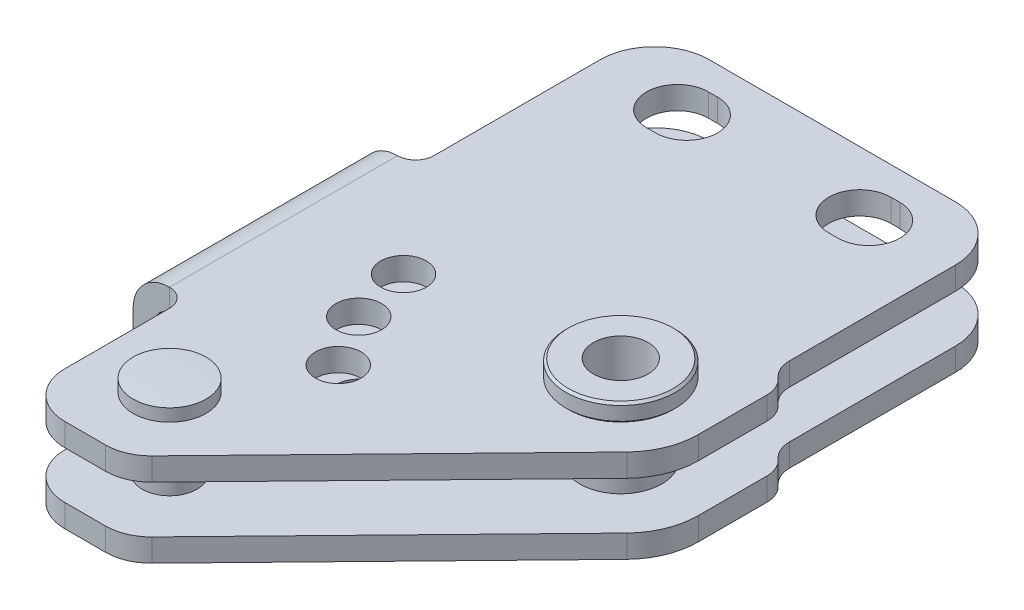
ISO-10303-21;
HEADER;
FILE_DESCRIPTION(('STEP AP214'),'2;1');
FILE_NAME('part.step','',(''),(''),'','','');
FILE_SCHEMA(('AUTOMOTIVE_DESIGN { 1 0 10303 214 1 1 1 1 }'));
ENDSEC;
DATA;
#1=APPLICATION_CONTEXT('core data for automotive mechanical design processes');
#2=APPLICATION_PROTOCOL_DEFINITION('international standard','automotive_design',2000,#1);
#3=PRODUCT_CONTEXT('',#1,'mechanical');
#4=PRODUCT('Part','Part','',(#3));
#5=PRODUCT_RELATED_PRODUCT_CATEGORY('part','',(#4));
#6=PRODUCT_DEFINITION_FORMATION('','',#4);
#7=PRODUCT_DEFINITION_CONTEXT('part definition',#1,'design');
#8=PRODUCT_DEFINITION('design','',#6,#7);
#9=PRODUCT_DEFINITION_SHAPE('','',#8);
#10=(LENGTH_UNIT() NAMED_UNIT(*) SI_UNIT(.MILLI.,.METRE.));
#11=(NAMED_UNIT(*) PLANE_ANGLE_UNIT() SI_UNIT($,.RADIAN.));
#12=(NAMED_UNIT(*) SI_UNIT($,.STERADIAN.) SOLID_ANGLE_UNIT());
#13=UNCERTAINTY_MEASURE_WITH_UNIT(LENGTH_MEASURE(1.E-05),#10,'distance_accuracy_value','');
#14=(GEOMETRIC_REPRESENTATION_CONTEXT(3) GLOBAL_UNCERTAINTY_ASSIGNED_CONTEXT((#13)) GLOBAL_UNIT_ASSIGNED_CONTEXT((#10,
#11,#12)) REPRESENTATION_CONTEXT('',''));
#15=CARTESIAN_POINT('',(0.,0.,0.));
#16=DIRECTION('',(0.,0.,1.));
#17=DIRECTION('',(1.,0.,0.));
#18=AXIS2_PLACEMENT_3D('',#15,#16,#17);
#19=CARTESIAN_POINT('',(1.,-5.1,-3.4));
#20=DIRECTION('',(0.,0.,-1.));
#21=DIRECTION('',(0.,-1.,0.));
#22=AXIS2_PLACEMENT_3D('',#19,#20,#21);
#23=PLANE('',#22);
#24=DIRECTION('',(1.,0.,0.));
#25=VECTOR('',#24,1.);
#26=CARTESIAN_POINT('',(1.,-2.6,-3.4));
#27=LINE('',#26,#25);
#28=CARTESIAN_POINT('',(0.,-2.6,-3.4));
#29=VERTEX_POINT('',#28);
#30=CARTESIAN_POINT('',(1.,-2.6,-3.4));
#31=VERTEX_POINT('',#30);
#32=EDGE_CURVE('E2304',#29,#31,#27,.T.);
#33=ORIENTED_EDGE('',*,*,#32,.F.);
#34=DIRECTION('',(0.,1.,0.));
#35=VECTOR('',#34,1.);
#36=CARTESIAN_POINT('',(0.,-5.1,-3.4));
#37=LINE('',#36,#35);
#38=CARTESIAN_POINT('',(0.,-5.1,-3.4));
#39=VERTEX_POINT('',#38);
#40=EDGE_CURVE('E502',#39,#29,#37,.T.);
#41=ORIENTED_EDGE('',*,*,#40,.F.);
#42=DIRECTION('',(-1.,0.,0.));
#43=VECTOR('',#42,1.);
#44=CARTESIAN_POINT('',(1.,-5.1,-3.4));
#45=LINE('',#44,#43);
#46=CARTESIAN_POINT('',(1.,-5.1,-3.4));
#47=VERTEX_POINT('',#46);
#48=EDGE_CURVE('E491',#47,#39,#45,.T.);
#49=ORIENTED_EDGE('',*,*,#48,.F.);
#50=DIRECTION('',(0.,1.,0.));
#51=VECTOR('',#50,1.);
#52=CARTESIAN_POINT('',(1.,-5.1,-3.4));
#53=LINE('',#52,#51);
#54=EDGE_CURVE('E505',#47,#31,#53,.T.);
#55=ORIENTED_EDGE('',*,*,#54,.T.);
#56=EDGE_LOOP('',(#33,#41,#49,#55));
#57=FACE_BOUND('',#56,.T.);
#58=ADVANCED_FACE('F15',(#57),#23,.F.);
#59=CARTESIAN_POINT('',(1.,-5.1,0.));
#60=DIRECTION('',(0.,1.,0.));
#61=DIRECTION('',(-1.,0.,0.));
#62=AXIS2_PLACEMENT_3D('',#59,#60,#61);
#63=CYLINDRICAL_SURFACE('',#62,3.4);
#64=CARTESIAN_POINT('',(1.,-2.6,0.));
#65=DIRECTION('',(0.,1.,0.));
#66=DIRECTION('',(-1.,0.,0.));
#67=AXIS2_PLACEMENT_3D('',#64,#65,#66);
#68=CIRCLE('',#67,3.4);
#69=CARTESIAN_POINT('',(1.,-2.6,3.4));
#70=VERTEX_POINT('',#69);
#71=EDGE_CURVE('E2308',#31,#70,#68,.F.);
#72=ORIENTED_EDGE('',*,*,#71,.F.);
#73=ORIENTED_EDGE('',*,*,#54,.F.);
#74=CARTESIAN_POINT('',(1.,-5.1,0.));
#75=DIRECTION('',(0.,1.,0.));
#76=DIRECTION('',(-1.,0.,0.));
#77=AXIS2_PLACEMENT_3D('',#74,#75,#76);
#78=CIRCLE('',#77,3.4);
#79=CARTESIAN_POINT('',(1.,-5.1,3.4));
#80=VERTEX_POINT('',#79);
#81=EDGE_CURVE('E488',#80,#47,#78,.T.);
#82=ORIENTED_EDGE('',*,*,#81,.F.);
#83=DIRECTION('',(0.,1.,0.));
#84=VECTOR('',#83,1.);
#85=CARTESIAN_POINT('',(1.,-5.1,3.4));
#86=LINE('',#85,#84);
#87=EDGE_CURVE('E508',#80,#70,#86,.T.);
#88=ORIENTED_EDGE('',*,*,#87,.T.);
#89=EDGE_LOOP('',(#72,#73,#82,#88));
#90=FACE_BOUND('',#89,.T.);
#91=ADVANCED_FACE('F850',(#90),#63,.F.);
#92=CARTESIAN_POINT('',(0.,-5.1,3.4));
#93=DIRECTION('',(0.,0.,1.));
#94=DIRECTION('',(0.,1.,0.));
#95=AXIS2_PLACEMENT_3D('',#92,#93,#94);
#96=PLANE('',#95);
#97=DIRECTION('',(-1.,0.,0.));
#98=VECTOR('',#97,1.);
#99=CARTESIAN_POINT('',(0.,-2.6,3.4));
#100=LINE('',#99,#98);
#101=CARTESIAN_POINT('',(0.,-2.6,3.4));
#102=VERTEX_POINT('',#101);
#103=EDGE_CURVE('E30',#70,#102,#100,.T.);
#104=ORIENTED_EDGE('',*,*,#103,.F.);
#105=ORIENTED_EDGE('',*,*,#87,.F.);
#106=DIRECTION('',(1.,0.,0.));
#107=VECTOR('',#106,1.);
#108=CARTESIAN_POINT('',(0.,-5.1,3.4));
#109=LINE('',#108,#107);
#110=CARTESIAN_POINT('',(0.,-5.1,3.4));
#111=VERTEX_POINT('',#110);
#112=EDGE_CURVE('E487',#111,#80,#109,.T.);
#113=ORIENTED_EDGE('',*,*,#112,.F.);
#114=DIRECTION('',(0.,1.,0.));
#115=VECTOR('',#114,1.);
#116=CARTESIAN_POINT('',(0.,-5.1,3.4));
#117=LINE('',#116,#115);
#118=EDGE_CURVE('E497',#111,#102,#117,.T.);
#119=ORIENTED_EDGE('',*,*,#118,.T.);
#120=EDGE_LOOP('',(#104,#105,#113,#119));
#121=FACE_BOUND('',#120,.T.);
#122=ADVANCED_FACE('F857',(#121),#96,.F.);
#123=CARTESIAN_POINT('',(0.,-5.1,0.));
#124=DIRECTION('',(0.,1.,0.));
#125=DIRECTION('',(-1.,0.,0.));
#126=AXIS2_PLACEMENT_3D('',#123,#124,#125);
#127=CYLINDRICAL_SURFACE('',#126,3.4);
#128=CARTESIAN_POINT('',(0.,-2.6,0.));
#129=DIRECTION('',(0.,1.,0.));
#130=DIRECTION('',(-1.,0.,0.));
#131=AXIS2_PLACEMENT_3D('',#128,#129,#130);
#132=CIRCLE('',#131,3.4);
#133=EDGE_CURVE('E2311',#102,#29,#132,.F.);
#134=ORIENTED_EDGE('',*,*,#133,.F.);
#135=ORIENTED_EDGE('',*,*,#118,.F.);
#136=CARTESIAN_POINT('',(0.,-5.1,0.));
#137=DIRECTION('',(0.,1.,0.));
#138=DIRECTION('',(1.,0.,0.));
#139=AXIS2_PLACEMENT_3D('',#136,#137,#138);
#140=CIRCLE('',#139,3.4);
#141=EDGE_CURVE('E494',#39,#111,#140,.T.);
#142=ORIENTED_EDGE('',*,*,#141,.F.);
#143=ORIENTED_EDGE('',*,*,#40,.T.);
#144=EDGE_LOOP('',(#134,#135,#142,#143));
#145=FACE_BOUND('',#144,.T.);
#146=ADVANCED_FACE('F862',(#145),#127,.F.);
#147=CARTESIAN_POINT('',(21.,-5.1,-3.4));
#148=DIRECTION('',(0.,0.,-1.));
#149=DIRECTION('',(0.,-1.,0.));
#150=AXIS2_PLACEMENT_3D('',#147,#148,#149);
#151=PLANE('',#150);
#152=DIRECTION('',(1.,0.,0.));
#153=VECTOR('',#152,1.);
#154=CARTESIAN_POINT('',(21.,-2.6,-3.4));
#155=LINE('',#154,#153);
#156=CARTESIAN_POINT('',(20.,-2.6,-3.4));
#157=VERTEX_POINT('',#156);
#158=CARTESIAN_POINT('',(21.,-2.6,-3.4));
#159=VERTEX_POINT('',#158);
#160=EDGE_CURVE('E2313',#157,#159,#155,.T.);
#161=ORIENTED_EDGE('',*,*,#160,.F.);
#162=DIRECTION('',(0.,1.,0.));
#163=VECTOR('',#162,1.);
#164=CARTESIAN_POINT('',(20.,-5.1,-3.4));
#165=LINE('',#164,#163);
#166=CARTESIAN_POINT('',(20.,-5.1,-3.4));
#167=VERTEX_POINT('',#166);
#168=EDGE_CURVE('E547',#167,#157,#165,.T.);
#169=ORIENTED_EDGE('',*,*,#168,.F.);
#170=DIRECTION('',(-1.,0.,0.));
#171=VECTOR('',#170,1.);
#172=CARTESIAN_POINT('',(21.,-5.1,-3.4));
#173=LINE('',#172,#171);
#174=CARTESIAN_POINT('',(21.,-5.1,-3.4));
#175=VERTEX_POINT('',#174);
#176=EDGE_CURVE('E536',#175,#167,#173,.T.);
#177=ORIENTED_EDGE('',*,*,#176,.F.);
#178=DIRECTION('',(0.,1.,0.));
#179=VECTOR('',#178,1.);
#180=CARTESIAN_POINT('',(21.,-5.1,-3.4));
#181=LINE('',#180,#179);
#182=EDGE_CURVE('E550',#175,#159,#181,.T.);
#183=ORIENTED_EDGE('',*,*,#182,.T.);
#184=EDGE_LOOP('',(#161,#169,#177,#183));
#185=FACE_BOUND('',#184,.T.);
#186=ADVANCED_FACE('F893',(#185),#151,.F.);
#187=CARTESIAN_POINT('',(21.,-5.1,0.));
#188=DIRECTION('',(0.,1.,0.));
#189=DIRECTION('',(-1.,0.,0.));
#190=AXIS2_PLACEMENT_3D('',#187,#188,#189);
#191=CYLINDRICAL_SURFACE('',#190,3.4);
#192=CARTESIAN_POINT('',(21.,-2.6,0.));
#193=DIRECTION('',(0.,1.,0.));
#194=DIRECTION('',(-1.,0.,0.));
#195=AXIS2_PLACEMENT_3D('',#192,#193,#194);
#196=CIRCLE('',#195,3.4);
#197=CARTESIAN_POINT('',(21.,-2.6,3.4));
#198=VERTEX_POINT('',#197);
#199=EDGE_CURVE('E2315',#159,#198,#196,.F.);
#200=ORIENTED_EDGE('',*,*,#199,.F.);
#201=ORIENTED_EDGE('',*,*,#182,.F.);
#202=CARTESIAN_POINT('',(21.,-5.1,0.));
#203=DIRECTION('',(0.,1.,0.));
#204=DIRECTION('',(-1.,0.,0.));
#205=AXIS2_PLACEMENT_3D('',#202,#203,#204);
#206=CIRCLE('',#205,3.4);
#207=CARTESIAN_POINT('',(21.,-5.1,3.4));
#208=VERTEX_POINT('',#207);
#209=EDGE_CURVE('E533',#208,#175,#206,.T.);
#210=ORIENTED_EDGE('',*,*,#209,.F.);
#211=DIRECTION('',(0.,1.,0.));
#212=VECTOR('',#211,1.);
#213=CARTESIAN_POINT('',(21.,-5.1,3.4));
#214=LINE('',#213,#212);
#215=EDGE_CURVE('E553',#208,#198,#214,.T.);
#216=ORIENTED_EDGE('',*,*,#215,.T.);
#217=EDGE_LOOP('',(#200,#201,#210,#216));
#218=FACE_BOUND('',#217,.T.);
#219=ADVANCED_FACE('F896',(#218),#191,.F.);
#220=CARTESIAN_POINT('',(20.,-5.1,3.4));
#221=DIRECTION('',(0.,0.,1.));
#222=DIRECTION('',(0.,1.,0.));
#223=AXIS2_PLACEMENT_3D('',#220,#221,#222);
#224=PLANE('',#223);
#225=DIRECTION('',(-1.,0.,0.));
#226=VECTOR('',#225,1.);
#227=CARTESIAN_POINT('',(20.,-2.6,3.4));
#228=LINE('',#227,#226);
#229=CARTESIAN_POINT('',(20.,-2.6,3.4));
#230=VERTEX_POINT('',#229);
#231=EDGE_CURVE('E38',#198,#230,#228,.T.);
#232=ORIENTED_EDGE('',*,*,#231,.F.);
#233=ORIENTED_EDGE('',*,*,#215,.F.);
#234=DIRECTION('',(1.,0.,0.));
#235=VECTOR('',#234,1.);
#236=CARTESIAN_POINT('',(20.,-5.1,3.4));
#237=LINE('',#236,#235);
#238=CARTESIAN_POINT('',(20.,-5.1,3.4));
#239=VERTEX_POINT('',#238);
#240=EDGE_CURVE('E532',#239,#208,#237,.T.);
#241=ORIENTED_EDGE('',*,*,#240,.F.);
#242=DIRECTION('',(0.,1.,0.));
#243=VECTOR('',#242,1.);
#244=CARTESIAN_POINT('',(20.,-5.1,3.4));
#245=LINE('',#244,#243);
#246=EDGE_CURVE('E542',#239,#230,#245,.T.);
#247=ORIENTED_EDGE('',*,*,#246,.T.);
#248=EDGE_LOOP('',(#232,#233,#241,#247));
#249=FACE_BOUND('',#248,.T.);
#250=ADVANCED_FACE('F891',(#249),#224,.F.);
#251=CARTESIAN_POINT('',(20.,-5.1,0.));
#252=DIRECTION('',(0.,1.,0.));
#253=DIRECTION('',(-1.,0.,0.));
#254=AXIS2_PLACEMENT_3D('',#251,#252,#253);
#255=CYLINDRICAL_SURFACE('',#254,3.4);
#256=CARTESIAN_POINT('',(20.,-2.6,0.));
#257=DIRECTION('',(0.,1.,0.));
#258=DIRECTION('',(-1.,0.,0.));
#259=AXIS2_PLACEMENT_3D('',#256,#257,#258);
#260=CIRCLE('',#259,3.4);
#261=EDGE_CURVE('E2318',#230,#157,#260,.F.);
#262=ORIENTED_EDGE('',*,*,#261,.F.);
#263=ORIENTED_EDGE('',*,*,#246,.F.);
#264=CARTESIAN_POINT('',(20.,-5.1,0.));
#265=DIRECTION('',(0.,1.,0.));
#266=DIRECTION('',(1.,0.,0.));
#267=AXIS2_PLACEMENT_3D('',#264,#265,#266);
#268=CIRCLE('',#267,3.4);
#269=EDGE_CURVE('E539',#167,#239,#268,.T.);
#270=ORIENTED_EDGE('',*,*,#269,.F.);
#271=ORIENTED_EDGE('',*,*,#168,.T.);
#272=EDGE_LOOP('',(#262,#263,#270,#271));
#273=FACE_BOUND('',#272,.T.);
#274=ADVANCED_FACE('F887',(#273),#255,.F.);
#275=CARTESIAN_POINT('',(5.647022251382,-5.1,42.861327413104));
#276=DIRECTION('',(0.,1.,0.));
#277=DIRECTION('',(-1.,0.,0.));
#278=AXIS2_PLACEMENT_3D('',#275,#276,#277);
#279=CYLINDRICAL_SURFACE('',#278,2.5);
#280=CARTESIAN_POINT('',(5.647022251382,-5.1,42.861327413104));
#281=DIRECTION('',(0.,1.,0.));
#282=DIRECTION('',(-1.,0.,0.));
#283=AXIS2_PLACEMENT_3D('',#280,#281,#282);
#284=CIRCLE('',#283,2.5);
#285=CARTESIAN_POINT('',(3.147022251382,-5.1,42.861327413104));
#286=VERTEX_POINT('',#285);
#287=EDGE_CURVE('E559',#286,#286,#284,.T.);
#288=ORIENTED_EDGE('',*,*,#287,.F.);
#289=EDGE_LOOP('',(#288));
#290=FACE_BOUND('',#289,.T.);
#291=CARTESIAN_POINT('',(5.647022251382,-2.6,42.861327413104));
#292=DIRECTION('',(0.,1.,0.));
#293=DIRECTION('',(-1.,0.,0.));
#294=AXIS2_PLACEMENT_3D('',#291,#292,#293);
#295=CIRCLE('',#294,2.5);
#296=CARTESIAN_POINT('',(3.147022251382,-2.6,42.861327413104));
#297=VERTEX_POINT('',#296);
#298=EDGE_CURVE('E2320',#297,#297,#295,.F.);
#299=ORIENTED_EDGE('',*,*,#298,.F.);
#300=EDGE_LOOP('',(#299));
#301=FACE_BOUND('',#300,.T.);
#302=ADVANCED_FACE('F890',(#290,#301),#279,.F.);
#303=CARTESIAN_POINT('',(2.17465028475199,-5.1,37.139035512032));
#304=DIRECTION('',(0.,1.,0.));
#305=DIRECTION('',(-1.,0.,0.));
#306=AXIS2_PLACEMENT_3D('',#303,#304,#305);
#307=CYLINDRICAL_SURFACE('',#306,2.5);
#308=CARTESIAN_POINT('',(2.17465028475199,-5.1,37.139035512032));
#309=DIRECTION('',(0.,1.,0.));
#310=DIRECTION('',(-1.,0.,0.));
#311=AXIS2_PLACEMENT_3D('',#308,#309,#310);
#312=CIRCLE('',#311,2.5);
#313=CARTESIAN_POINT('',(-0.325349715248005,-5.1,37.139035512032));
#314=VERTEX_POINT('',#313);
#315=EDGE_CURVE('E565',#314,#314,#312,.T.);
#316=ORIENTED_EDGE('',*,*,#315,.F.);
#317=EDGE_LOOP('',(#316));
#318=FACE_BOUND('',#317,.T.);
#319=CARTESIAN_POINT('',(2.17465028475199,-2.6,37.139035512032));
#320=DIRECTION('',(0.,1.,0.));
#321=DIRECTION('',(-1.,0.,0.));
#322=AXIS2_PLACEMENT_3D('',#319,#320,#321);
#323=CIRCLE('',#322,2.5);
#324=CARTESIAN_POINT('',(-0.325349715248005,-2.6,37.139035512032));
#325=VERTEX_POINT('',#324);
#326=EDGE_CURVE('E2323',#325,#325,#323,.F.);
#327=ORIENTED_EDGE('',*,*,#326,.F.);
#328=EDGE_LOOP('',(#327));
#329=FACE_BOUND('',#328,.T.);
#330=ADVANCED_FACE('F912',(#318,#329),#307,.F.);
#331=CARTESIAN_POINT('',(0.583716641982,-5.1,30.637426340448));
#332=DIRECTION('',(0.,1.,0.));
#333=DIRECTION('',(-1.,0.,0.));
#334=AXIS2_PLACEMENT_3D('',#331,#332,#333);
#335=CYLINDRICAL_SURFACE('',#334,2.5);
#336=CARTESIAN_POINT('',(0.583716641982,-5.1,30.637426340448));
#337=DIRECTION('',(0.,1.,0.));
#338=DIRECTION('',(-1.,0.,0.));
#339=AXIS2_PLACEMENT_3D('',#336,#337,#338);
#340=CIRCLE('',#339,2.5);
#341=CARTESIAN_POINT('',(-1.916283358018,-5.1,30.637426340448));
#342=VERTEX_POINT('',#341);
#343=EDGE_CURVE('E571',#342,#342,#340,.T.);
#344=ORIENTED_EDGE('',*,*,#343,.F.);
#345=EDGE_LOOP('',(#344));
#346=FACE_BOUND('',#345,.T.);
#347=CARTESIAN_POINT('',(0.583716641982,-2.6,30.637426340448));
#348=DIRECTION('',(0.,1.,0.));
#349=DIRECTION('',(-1.,0.,0.));
#350=AXIS2_PLACEMENT_3D('',#347,#348,#349);
#351=CIRCLE('',#350,2.5);
#352=CARTESIAN_POINT('',(-1.916283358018,-2.6,30.637426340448));
#353=VERTEX_POINT('',#352);
#354=EDGE_CURVE('E2326',#353,#353,#351,.F.);
#355=ORIENTED_EDGE('',*,*,#354,.F.);
#356=EDGE_LOOP('',(#355));
#357=FACE_BOUND('',#356,.T.);
#358=ADVANCED_FACE('F920',(#346,#357),#335,.F.);
#359=CARTESIAN_POINT('',(-11.,-5.1,17.7199999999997));
#360=DIRECTION('',(0.,1.,0.));
#361=DIRECTION('',(-1.,0.,0.));
#362=AXIS2_PLACEMENT_3D('',#359,#360,#361);
#363=CYLINDRICAL_SURFACE('',#362,2.00000000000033);
#364=DIRECTION('',(0.,1.,0.));
#365=VECTOR('',#364,1.);
#366=CARTESIAN_POINT('',(-11.,-5.1,19.72));
#367=LINE('',#366,#365);
#368=CARTESIAN_POINT('',(-11.,-5.1,19.72));
#369=VERTEX_POINT('',#368);
#370=CARTESIAN_POINT('',(-11.,-2.6,19.72));
#371=VERTEX_POINT('',#370);
#372=EDGE_CURVE('E749',#369,#371,#367,.T.);
#373=ORIENTED_EDGE('',*,*,#372,.T.);
#374=CARTESIAN_POINT('',(-11.,-2.6,17.7199999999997));
#375=DIRECTION('',(0.,-1.,0.));
#376=DIRECTION('',(-1.,0.,0.));
#377=AXIS2_PLACEMENT_3D('',#374,#375,#376);
#378=CIRCLE('',#377,2.00000000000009);
#379=CARTESIAN_POINT('',(-9.,-2.6,17.72));
#380=VERTEX_POINT('',#379);
#381=EDGE_CURVE('E379',#380,#371,#378,.T.);
#382=ORIENTED_EDGE('',*,*,#381,.F.);
#383=DIRECTION('',(0.,1.,0.));
#384=VECTOR('',#383,1.);
#385=CARTESIAN_POINT('',(-9.,-5.1,17.72));
#386=LINE('',#385,#384);
#387=CARTESIAN_POINT('',(-9.,-5.1,17.72));
#388=VERTEX_POINT('',#387);
#389=EDGE_CURVE('E378',#388,#380,#386,.T.);
#390=ORIENTED_EDGE('',*,*,#389,.F.);
#391=CARTESIAN_POINT('',(-11.,-5.1,17.7199999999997));
#392=DIRECTION('',(0.,-1.,0.));
#393=DIRECTION('',(-1.,0.,0.));
#394=AXIS2_PLACEMENT_3D('',#391,#392,#393);
#395=CIRCLE('',#394,2.00000000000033);
#396=EDGE_CURVE('E686',#388,#369,#395,.T.);
#397=ORIENTED_EDGE('',*,*,#396,.T.);
#398=EDGE_LOOP('',(#373,#382,#390,#397));
#399=FACE_BOUND('',#398,.T.);
#400=ADVANCED_FACE('F928',(#399),#363,.F.);
#401=CARTESIAN_POINT('',(-11.,-5.1,46.72));
#402=DIRECTION('',(0.,1.,0.));
#403=DIRECTION('',(-1.,0.,0.));
#404=AXIS2_PLACEMENT_3D('',#401,#402,#403);
#405=CYLINDRICAL_SURFACE('',#404,2.00000000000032);
#406=DIRECTION('',(0.,1.,0.));
#407=VECTOR('',#406,1.);
#408=CARTESIAN_POINT('',(-9.,-5.1,46.72));
#409=LINE('',#408,#407);
#410=CARTESIAN_POINT('',(-9.,-5.1,46.72));
#411=VERTEX_POINT('',#410);
#412=CARTESIAN_POINT('',(-9.,-2.6,46.72));
#413=VERTEX_POINT('',#412);
#414=EDGE_CURVE('E736',#411,#413,#409,.T.);
#415=ORIENTED_EDGE('',*,*,#414,.T.);
#416=CARTESIAN_POINT('',(-11.,-2.6,46.72));
#417=DIRECTION('',(0.,-1.,0.));
#418=DIRECTION('',(-1.,0.,0.));
#419=AXIS2_PLACEMENT_3D('',#416,#417,#418);
#420=CIRCLE('',#419,2.);
#421=CARTESIAN_POINT('',(-11.,-2.6,44.72));
#422=VERTEX_POINT('',#421);
#423=EDGE_CURVE('E2352',#422,#413,#420,.T.);
#424=ORIENTED_EDGE('',*,*,#423,.F.);
#425=DIRECTION('',(0.,1.,0.));
#426=VECTOR('',#425,1.);
#427=CARTESIAN_POINT('',(-11.,-5.1,44.72));
#428=LINE('',#427,#426);
#429=CARTESIAN_POINT('',(-11.,-5.1,44.72));
#430=VERTEX_POINT('',#429);
#431=EDGE_CURVE('E740',#430,#422,#428,.T.);
#432=ORIENTED_EDGE('',*,*,#431,.F.);
#433=CARTESIAN_POINT('',(-11.,-5.1,46.72));
#434=DIRECTION('',(0.,-1.,0.));
#435=DIRECTION('',(-1.,0.,0.));
#436=AXIS2_PLACEMENT_3D('',#433,#434,#435);
#437=CIRCLE('',#436,2.00000000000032);
#438=EDGE_CURVE('E689',#430,#411,#437,.T.);
#439=ORIENTED_EDGE('',*,*,#438,.T.);
#440=EDGE_LOOP('',(#415,#424,#432,#439));
#441=FACE_BOUND('',#440,.T.);
#442=ADVANCED_FACE('F998',(#441),#405,.F.);
#443=CARTESIAN_POINT('',(-9.,-5.1,46.72));
#444=DIRECTION('',(-1.,0.,0.));
#445=DIRECTION('',(0.,-1.,0.));
#446=AXIS2_PLACEMENT_3D('',#443,#444,#445);
#447=PLANE('',#446);
#448=DIRECTION('',(0.,1.,0.));
#449=VECTOR('',#448,1.);
#450=CARTESIAN_POINT('',(-9.,-5.1,58.22));
#451=LINE('',#450,#449);
#452=CARTESIAN_POINT('',(-9.,-5.1,58.22));
#453=VERTEX_POINT('',#452);
#454=CARTESIAN_POINT('',(-9.,-2.6,58.2200000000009));
#455=VERTEX_POINT('',#454);
#456=EDGE_CURVE('E732',#453,#455,#451,.T.);
#457=ORIENTED_EDGE('',*,*,#456,.T.);
#458=DIRECTION('',(0.,0.,1.));
#459=VECTOR('',#458,1.);
#460=CARTESIAN_POINT('',(-9.,-2.6,46.72));
#461=LINE('',#460,#459);
#462=EDGE_CURVE('E2350',#413,#455,#461,.T.);
#463=ORIENTED_EDGE('',*,*,#462,.F.);
#464=ORIENTED_EDGE('',*,*,#414,.F.);
#465=DIRECTION('',(0.,0.,1.));
#466=VECTOR('',#465,1.);
#467=CARTESIAN_POINT('',(-9.,-5.1,46.72));
#468=LINE('',#467,#466);
#469=EDGE_CURVE('E692',#411,#453,#468,.T.);
#470=ORIENTED_EDGE('',*,*,#469,.T.);
#471=EDGE_LOOP('',(#457,#463,#464,#470));
#472=FACE_BOUND('',#471,.T.);
#473=ADVANCED_FACE('F993',(#472),#447,.T.);
#474=CARTESIAN_POINT('',(-4.00000000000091,-5.1,58.2200000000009));
#475=DIRECTION('',(0.,1.,0.));
#476=DIRECTION('',(-1.,0.,0.));
#477=AXIS2_PLACEMENT_3D('',#474,#475,#476);
#478=CYLINDRICAL_SURFACE('',#477,4.99999999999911);
#479=DIRECTION('',(0.,1.,0.));
#480=VECTOR('',#479,1.);
#481=CARTESIAN_POINT('',(-4.,-5.1,63.22));
#482=LINE('',#481,#480);
#483=CARTESIAN_POINT('',(-4.,-5.1,63.22));
#484=VERTEX_POINT('',#483);
#485=CARTESIAN_POINT('',(-4.,-2.6,63.22));
#486=VERTEX_POINT('',#485);
#487=EDGE_CURVE('E728',#484,#486,#482,.T.);
#488=ORIENTED_EDGE('',*,*,#487,.T.);
#489=CARTESIAN_POINT('',(-4.00000000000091,-2.6,58.2200000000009));
#490=DIRECTION('',(0.,1.,0.));
#491=DIRECTION('',(-1.,0.,0.));
#492=AXIS2_PLACEMENT_3D('',#489,#490,#491);
#493=CIRCLE('',#492,4.9999999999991);
#494=EDGE_CURVE('E2348',#455,#486,#493,.T.);
#495=ORIENTED_EDGE('',*,*,#494,.F.);
#496=ORIENTED_EDGE('',*,*,#456,.F.);
#497=CARTESIAN_POINT('',(-4.00000000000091,-5.1,58.2200000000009));
#498=DIRECTION('',(0.,1.,0.));
#499=DIRECTION('',(-1.,0.,0.));
#500=AXIS2_PLACEMENT_3D('',#497,#498,#499);
#501=CIRCLE('',#500,4.99999999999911);
#502=EDGE_CURVE('E695',#453,#484,#501,.T.);
#503=ORIENTED_EDGE('',*,*,#502,.T.);
#504=EDGE_LOOP('',(#488,#495,#496,#503));
#505=FACE_BOUND('',#504,.T.);
#506=ADVANCED_FACE('F988',(#505),#478,.T.);
#507=CARTESIAN_POINT('',(-4.,-5.1,63.22));
#508=DIRECTION('',(0.,0.,1.));
#509=DIRECTION('',(0.,1.,0.));
#510=AXIS2_PLACEMENT_3D('',#507,#508,#509);
#511=PLANE('',#510);
#512=DIRECTION('',(0.,1.,0.));
#513=VECTOR('',#512,1.);
#514=CARTESIAN_POINT('',(0.48,-5.1,63.22));
#515=LINE('',#514,#513);
#516=CARTESIAN_POINT('',(0.48,-5.1,63.22));
#517=VERTEX_POINT('',#516);
#518=CARTESIAN_POINT('',(0.480000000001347,-2.6,63.22));
#519=VERTEX_POINT('',#518);
#520=EDGE_CURVE('E724',#517,#519,#515,.T.);
#521=ORIENTED_EDGE('',*,*,#520,.T.);
#522=DIRECTION('',(1.,0.,0.));
#523=VECTOR('',#522,1.);
#524=CARTESIAN_POINT('',(-4.,-2.6,63.22));
#525=LINE('',#524,#523);
#526=EDGE_CURVE('E2346',#486,#519,#525,.T.);
#527=ORIENTED_EDGE('',*,*,#526,.F.);
#528=ORIENTED_EDGE('',*,*,#487,.F.);
#529=DIRECTION('',(1.,0.,0.));
#530=VECTOR('',#529,1.);
#531=CARTESIAN_POINT('',(-4.,-5.1,63.22));
#532=LINE('',#531,#530);
#533=EDGE_CURVE('E697',#484,#517,#532,.T.);
#534=ORIENTED_EDGE('',*,*,#533,.T.);
#535=EDGE_LOOP('',(#521,#527,#528,#534));
#536=FACE_BOUND('',#535,.T.);
#537=ADVANCED_FACE('F983',(#536),#511,.T.);
#538=CARTESIAN_POINT('',(0.480000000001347,-5.1,58.2200000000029));
#539=DIRECTION('',(0.,1.,0.));
#540=DIRECTION('',(-1.,0.,0.));
#541=AXIS2_PLACEMENT_3D('',#538,#539,#540);
#542=CYLINDRICAL_SURFACE('',#541,4.99999999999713);
#543=DIRECTION('',(0.,1.,0.));
#544=VECTOR('',#543,1.);
#545=CARTESIAN_POINT('',(4.065259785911,-5.1,61.705098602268));
#546=LINE('',#545,#544);
#547=CARTESIAN_POINT('',(4.065259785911,-5.1,61.705098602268));
#548=VERTEX_POINT('',#547);
#549=CARTESIAN_POINT('',(4.065259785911,-2.6,61.705098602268));
#550=VERTEX_POINT('',#549);
#551=EDGE_CURVE('E720',#548,#550,#546,.T.);
#552=ORIENTED_EDGE('',*,*,#551,.T.);
#553=CARTESIAN_POINT('',(0.480000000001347,-2.6,58.2200000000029));
#554=DIRECTION('',(0.,1.,0.));
#555=DIRECTION('',(-1.,0.,0.));
#556=AXIS2_PLACEMENT_3D('',#553,#554,#555);
#557=CIRCLE('',#556,4.99999999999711);
#558=EDGE_CURVE('E2344',#519,#550,#557,.T.);
#559=ORIENTED_EDGE('',*,*,#558,.F.);
#560=ORIENTED_EDGE('',*,*,#520,.F.);
#561=CARTESIAN_POINT('',(0.480000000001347,-5.1,58.2200000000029));
#562=DIRECTION('',(0.,1.,0.));
#563=DIRECTION('',(-1.,0.,0.));
#564=AXIS2_PLACEMENT_3D('',#561,#562,#563);
#565=CIRCLE('',#564,4.99999999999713);
#566=EDGE_CURVE('E700',#517,#548,#565,.T.);
#567=ORIENTED_EDGE('',*,*,#566,.T.);
#568=EDGE_LOOP('',(#552,#559,#560,#567));
#569=FACE_BOUND('',#568,.T.);
#570=ADVANCED_FACE('F978',(#569),#542,.T.);
#571=CARTESIAN_POINT('',(4.065259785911,-5.1,61.705098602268));
#572=DIRECTION('',(0.717051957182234,0.,0.697019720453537));
#573=DIRECTION('',(0.697019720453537,0.,-0.717051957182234));
#574=AXIS2_PLACEMENT_3D('',#571,#572,#573);
#575=PLANE('',#574);
#576=DIRECTION('',(0.,1.,0.));
#577=VECTOR('',#576,1.);
#578=CARTESIAN_POINT('',(29.7364156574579,-5.1,35.296157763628));
#579=LINE('',#578,#577);
#580=CARTESIAN_POINT('',(29.7364156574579,-5.1,35.296157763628));
#581=VERTEX_POINT('',#580);
#582=CARTESIAN_POINT('',(29.7364156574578,-2.6,35.296157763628));
#583=VERTEX_POINT('',#582);
#584=EDGE_CURVE('E716',#581,#583,#579,.T.);
#585=ORIENTED_EDGE('',*,*,#584,.T.);
#586=DIRECTION('',(0.697019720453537,0.,-0.717051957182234));
#587=VECTOR('',#586,1.);
#588=CARTESIAN_POINT('',(4.065259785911,-2.6,61.705098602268));
#589=LINE('',#588,#587);
#590=EDGE_CURVE('E2342',#550,#583,#589,.T.);
#591=ORIENTED_EDGE('',*,*,#590,.F.);
#592=ORIENTED_EDGE('',*,*,#551,.F.);
#593=DIRECTION('',(0.697019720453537,0.,-0.717051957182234));
#594=VECTOR('',#593,1.);
#595=CARTESIAN_POINT('',(4.065259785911,-5.1,61.705098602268));
#596=LINE('',#595,#594);
#597=EDGE_CURVE('E703',#548,#581,#596,.T.);
#598=ORIENTED_EDGE('',*,*,#597,.T.);
#599=EDGE_LOOP('',(#585,#591,#592,#598));
#600=FACE_BOUND('',#599,.T.);
#601=ADVANCED_FACE('F973',(#600),#575,.T.);
#602=CARTESIAN_POINT('',(24.0000000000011,-5.1,29.72));
#603=DIRECTION('',(0.,1.,0.));
#604=DIRECTION('',(-1.,0.,0.));
#605=AXIS2_PLACEMENT_3D('',#602,#603,#604);
#606=CYLINDRICAL_SURFACE('',#605,7.99999999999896);
#607=DIRECTION('',(0.,1.,0.));
#608=VECTOR('',#607,1.);
#609=CARTESIAN_POINT('',(32.,-5.1,29.72));
#610=LINE('',#609,#608);
#611=CARTESIAN_POINT('',(32.,-5.1,29.72));
#612=VERTEX_POINT('',#611);
#613=CARTESIAN_POINT('',(32.,-2.6,29.72));
#614=VERTEX_POINT('',#613);
#615=EDGE_CURVE('E712',#612,#614,#610,.T.);
#616=ORIENTED_EDGE('',*,*,#615,.T.);
#617=CARTESIAN_POINT('',(24.0000000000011,-2.6,29.72));
#618=DIRECTION('',(0.,1.,0.));
#619=DIRECTION('',(-1.,0.,0.));
#620=AXIS2_PLACEMENT_3D('',#617,#618,#619);
#621=CIRCLE('',#620,7.999999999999);
#622=EDGE_CURVE('E2340',#583,#614,#621,.T.);
#623=ORIENTED_EDGE('',*,*,#622,.F.);
#624=ORIENTED_EDGE('',*,*,#584,.F.);
#625=CARTESIAN_POINT('',(24.0000000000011,-5.1,29.72));
#626=DIRECTION('',(0.,1.,0.));
#627=DIRECTION('',(-1.,0.,0.));
#628=AXIS2_PLACEMENT_3D('',#625,#626,#627);
#629=CIRCLE('',#628,7.99999999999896);
#630=EDGE_CURVE('E706',#581,#612,#629,.T.);
#631=ORIENTED_EDGE('',*,*,#630,.T.);
#632=EDGE_LOOP('',(#616,#623,#624,#631));
#633=FACE_BOUND('',#632,.T.);
#634=ADVANCED_FACE('F969',(#633),#606,.T.);
#635=CARTESIAN_POINT('',(32.,-5.1,29.72));
#636=DIRECTION('',(1.,0.,0.));
#637=DIRECTION('',(0.,1.,0.));
#638=AXIS2_PLACEMENT_3D('',#635,#636,#637);
#639=PLANE('',#638);
#640=DIRECTION('',(0.,1.,0.));
#641=VECTOR('',#640,1.);
#642=CARTESIAN_POINT('',(32.,-5.1,22.19));
#643=LINE('',#642,#641);
#644=CARTESIAN_POINT('',(32.,-5.1,22.19));
#645=VERTEX_POINT('',#644);
#646=CARTESIAN_POINT('',(32.,-2.6,22.19));
#647=VERTEX_POINT('',#646);
#648=EDGE_CURVE('E409',#645,#647,#643,.T.);
#649=ORIENTED_EDGE('',*,*,#648,.T.);
#650=DIRECTION('',(0.,0.,-1.));
#651=VECTOR('',#650,1.);
#652=CARTESIAN_POINT('',(32.,-2.6,29.72));
#653=LINE('',#652,#651);
#654=EDGE_CURVE('E2338',#614,#647,#653,.T.);
#655=ORIENTED_EDGE('',*,*,#654,.F.);
#656=ORIENTED_EDGE('',*,*,#615,.F.);
#657=DIRECTION('',(0.,0.,-1.));
#658=VECTOR('',#657,1.);
#659=CARTESIAN_POINT('',(32.,-5.1,29.72));
#660=LINE('',#659,#658);
#661=EDGE_CURVE('E665',#612,#645,#660,.T.);
#662=ORIENTED_EDGE('',*,*,#661,.T.);
#663=EDGE_LOOP('',(#649,#655,#656,#662));
#664=FACE_BOUND('',#663,.T.);
#665=ADVANCED_FACE('F972',(#664),#639,.T.);
#666=CARTESIAN_POINT('',(29.0000000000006,-5.1,22.1899999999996));
#667=DIRECTION('',(0.,1.,0.));
#668=DIRECTION('',(-1.,0.,0.));
#669=AXIS2_PLACEMENT_3D('',#666,#667,#668);
#670=CYLINDRICAL_SURFACE('',#669,2.99999999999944);
#671=DIRECTION('',(0.,1.,0.));
#672=VECTOR('',#671,1.);
#673=CARTESIAN_POINT('',(31.,-5.1,19.9539320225));
#674=LINE('',#673,#672);
#675=CARTESIAN_POINT('',(31.,-5.1,19.9539320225));
#676=VERTEX_POINT('',#675);
#677=CARTESIAN_POINT('',(31.,-2.6,19.9539320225));
#678=VERTEX_POINT('',#677);
#679=EDGE_CURVE('E405',#676,#678,#674,.T.);
#680=ORIENTED_EDGE('',*,*,#679,.T.);
#681=CARTESIAN_POINT('',(29.0000000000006,-2.6,22.1899999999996));
#682=DIRECTION('',(0.,1.,0.));
#683=DIRECTION('',(-1.,0.,0.));
#684=AXIS2_PLACEMENT_3D('',#681,#682,#683);
#685=CIRCLE('',#684,2.99999999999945);
#686=EDGE_CURVE('E2336',#647,#678,#685,.T.);
#687=ORIENTED_EDGE('',*,*,#686,.F.);
#688=ORIENTED_EDGE('',*,*,#648,.F.);
#689=CARTESIAN_POINT('',(29.0000000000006,-5.1,22.1899999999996));
#690=DIRECTION('',(0.,1.,0.));
#691=DIRECTION('',(-1.,0.,0.));
#692=AXIS2_PLACEMENT_3D('',#689,#690,#691);
#693=CIRCLE('',#692,2.99999999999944);
#694=EDGE_CURVE('E668',#645,#676,#693,.T.);
#695=ORIENTED_EDGE('',*,*,#694,.T.);
#696=EDGE_LOOP('',(#680,#687,#688,#695));
#697=FACE_BOUND('',#696,.T.);
#698=ADVANCED_FACE('F1038',(#697),#670,.T.);
#699=CARTESIAN_POINT('',(32.9999999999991,-5.1,17.7178640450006));
#700=DIRECTION('',(0.,1.,0.));
#701=DIRECTION('',(-1.,0.,0.));
#702=AXIS2_PLACEMENT_3D('',#699,#700,#701);
#703=CYLINDRICAL_SURFACE('',#702,2.99999999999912);
#704=DIRECTION('',(0.,1.,0.));
#705=VECTOR('',#704,1.);
#706=CARTESIAN_POINT('',(30.,-5.1,17.717864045));
#707=LINE('',#706,#705);
#708=CARTESIAN_POINT('',(30.,-5.1,17.717864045));
#709=VERTEX_POINT('',#708);
#710=CARTESIAN_POINT('',(30.,-2.6,17.7178640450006));
#711=VERTEX_POINT('',#710);
#712=EDGE_CURVE('E401',#709,#711,#707,.T.);
#713=ORIENTED_EDGE('',*,*,#712,.T.);
#714=CARTESIAN_POINT('',(32.9999999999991,-2.6,17.7178640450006));
#715=DIRECTION('',(0.,-1.,0.));
#716=DIRECTION('',(-1.,0.,0.));
#717=AXIS2_PLACEMENT_3D('',#714,#715,#716);
#718=CIRCLE('',#717,2.99999999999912);
#719=EDGE_CURVE('E2334',#678,#711,#718,.T.);
#720=ORIENTED_EDGE('',*,*,#719,.F.);
#721=ORIENTED_EDGE('',*,*,#679,.F.);
#722=CARTESIAN_POINT('',(32.9999999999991,-5.1,17.7178640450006));
#723=DIRECTION('',(0.,-1.,0.));
#724=DIRECTION('',(1.,0.,0.));
#725=AXIS2_PLACEMENT_3D('',#722,#723,#724);
#726=CIRCLE('',#725,2.99999999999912);
#727=EDGE_CURVE('E671',#676,#709,#726,.T.);
#728=ORIENTED_EDGE('',*,*,#727,.T.);
#729=EDGE_LOOP('',(#713,#720,#721,#728));
#730=FACE_BOUND('',#729,.T.);
#731=ADVANCED_FACE('F1033',(#730),#703,.F.);
#732=CARTESIAN_POINT('',(30.,-5.1,17.717864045));
#733=DIRECTION('',(1.,0.,0.));
#734=DIRECTION('',(0.,1.,0.));
#735=AXIS2_PLACEMENT_3D('',#732,#733,#734);
#736=PLANE('',#735);
#737=DIRECTION('',(0.,1.,0.));
#738=VECTOR('',#737,1.);
#739=CARTESIAN_POINT('',(30.,-5.1,-0.5));
#740=LINE('',#739,#738);
#741=CARTESIAN_POINT('',(30.,-5.1,-0.5));
#742=VERTEX_POINT('',#741);
#743=CARTESIAN_POINT('',(30.,-2.6,-0.5));
#744=VERTEX_POINT('',#743);
#745=EDGE_CURVE('E397',#742,#744,#740,.T.);
#746=ORIENTED_EDGE('',*,*,#745,.T.);
#747=DIRECTION('',(0.,0.,-1.));
#748=VECTOR('',#747,1.);
#749=CARTESIAN_POINT('',(30.,-2.6,17.7178640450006));
#750=LINE('',#749,#748);
#751=EDGE_CURVE('E2332',#711,#744,#750,.T.);
#752=ORIENTED_EDGE('',*,*,#751,.F.);
#753=ORIENTED_EDGE('',*,*,#712,.F.);
#754=DIRECTION('',(0.,0.,-1.));
#755=VECTOR('',#754,1.);
#756=CARTESIAN_POINT('',(30.,-5.1,17.717864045));
#757=LINE('',#756,#755);
#758=EDGE_CURVE('E674',#709,#742,#757,.T.);
#759=ORIENTED_EDGE('',*,*,#758,.T.);
#760=EDGE_LOOP('',(#746,#752,#753,#759));
#761=FACE_BOUND('',#760,.T.);
#762=ADVANCED_FACE('F1028',(#761),#736,.T.);
#763=CARTESIAN_POINT('',(24.,-5.1,-0.5));
#764=DIRECTION('',(0.,1.,0.));
#765=DIRECTION('',(-1.,0.,0.));
#766=AXIS2_PLACEMENT_3D('',#763,#764,#765);
#767=CYLINDRICAL_SURFACE('',#766,6.);
#768=DIRECTION('',(0.,1.,0.));
#769=VECTOR('',#768,1.);
#770=CARTESIAN_POINT('',(24.,-5.1,-6.5));
#771=LINE('',#770,#769);
#772=CARTESIAN_POINT('',(24.,-5.1,-6.5));
#773=VERTEX_POINT('',#772);
#774=CARTESIAN_POINT('',(24.,-2.6,-6.5));
#775=VERTEX_POINT('',#774);
#776=EDGE_CURVE('E393',#773,#775,#771,.T.);
#777=ORIENTED_EDGE('',*,*,#776,.T.);
#778=CARTESIAN_POINT('',(24.,-2.6,-0.5));
#779=DIRECTION('',(0.,1.,0.));
#780=DIRECTION('',(-1.,0.,0.));
#781=AXIS2_PLACEMENT_3D('',#778,#779,#780);
#782=CIRCLE('',#781,6.);
#783=EDGE_CURVE('E2330',#744,#775,#782,.T.);
#784=ORIENTED_EDGE('',*,*,#783,.F.);
#785=ORIENTED_EDGE('',*,*,#745,.F.);
#786=CARTESIAN_POINT('',(24.,-5.1,-0.5));
#787=DIRECTION('',(0.,1.,0.));
#788=DIRECTION('',(-1.,0.,0.));
#789=AXIS2_PLACEMENT_3D('',#786,#787,#788);
#790=CIRCLE('',#789,6.);
#791=EDGE_CURVE('E677',#742,#773,#790,.T.);
#792=ORIENTED_EDGE('',*,*,#791,.T.);
#793=EDGE_LOOP('',(#777,#784,#785,#792));
#794=FACE_BOUND('',#793,.T.);
#795=ADVANCED_FACE('F1024',(#794),#767,.T.);
#796=CARTESIAN_POINT('',(24.,-5.1,-6.5));
#797=DIRECTION('',(0.,0.,-1.));
#798=DIRECTION('',(0.,-1.,0.));
#799=AXIS2_PLACEMENT_3D('',#796,#797,#798);
#800=PLANE('',#799);
#801=DIRECTION('',(0.,1.,0.));
#802=VECTOR('',#801,1.);
#803=CARTESIAN_POINT('',(-3.,-5.1,-6.5));
#804=LINE('',#803,#802);
#805=CARTESIAN_POINT('',(-3.,-5.1,-6.5));
#806=VERTEX_POINT('',#805);
#807=CARTESIAN_POINT('',(-2.99999999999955,-2.6,-6.5));
#808=VERTEX_POINT('',#807);
#809=EDGE_CURVE('E387',#806,#808,#804,.T.);
#810=ORIENTED_EDGE('',*,*,#809,.T.);
#811=DIRECTION('',(-1.,0.,0.));
#812=VECTOR('',#811,1.);
#813=CARTESIAN_POINT('',(24.,-2.6,-6.5));
#814=LINE('',#813,#812);
#815=EDGE_CURVE('E365',#775,#808,#814,.T.);
#816=ORIENTED_EDGE('',*,*,#815,.F.);
#817=ORIENTED_EDGE('',*,*,#776,.F.);
#818=DIRECTION('',(-1.,0.,0.));
#819=VECTOR('',#818,1.);
#820=CARTESIAN_POINT('',(24.,-5.1,-6.5));
#821=LINE('',#820,#819);
#822=EDGE_CURVE('E680',#773,#806,#821,.T.);
#823=ORIENTED_EDGE('',*,*,#822,.T.);
#824=EDGE_LOOP('',(#810,#816,#817,#823));
#825=FACE_BOUND('',#824,.T.);
#826=ADVANCED_FACE('F1021',(#825),#800,.T.);
#827=CARTESIAN_POINT('',(-2.99999999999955,-5.1,-0.49999999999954));
#828=DIRECTION('',(0.,1.,0.));
#829=DIRECTION('',(-1.,0.,0.));
#830=AXIS2_PLACEMENT_3D('',#827,#828,#829);
#831=CYLINDRICAL_SURFACE('',#830,6.00000000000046);
#832=DIRECTION('',(0.,1.,0.));
#833=VECTOR('',#832,1.);
#834=CARTESIAN_POINT('',(-9.,-5.1,-0.49999999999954));
#835=LINE('',#834,#833);
#836=CARTESIAN_POINT('',(-9.,-5.1,-0.49999999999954));
#837=VERTEX_POINT('',#836);
#838=CARTESIAN_POINT('',(-9.,-2.6,-0.49999999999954));
#839=VERTEX_POINT('',#838);
#840=EDGE_CURVE('E376',#837,#839,#835,.T.);
#841=ORIENTED_EDGE('',*,*,#840,.T.);
#842=CARTESIAN_POINT('',(-2.99999999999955,-2.6,-0.49999999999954));
#843=DIRECTION('',(0.,1.,0.));
#844=DIRECTION('',(-1.,0.,0.));
#845=AXIS2_PLACEMENT_3D('',#842,#843,#844);
#846=CIRCLE('',#845,6.00000000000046);
#847=EDGE_CURVE('E358',#808,#839,#846,.T.);
#848=ORIENTED_EDGE('',*,*,#847,.F.);
#849=ORIENTED_EDGE('',*,*,#809,.F.);
#850=CARTESIAN_POINT('',(-2.99999999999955,-5.1,-0.49999999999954));
#851=DIRECTION('',(0.,1.,0.));
#852=DIRECTION('',(1.,0.,0.));
#853=AXIS2_PLACEMENT_3D('',#850,#851,#852);
#854=CIRCLE('',#853,6.00000000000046);
#855=EDGE_CURVE('E383',#806,#837,#854,.T.);
#856=ORIENTED_EDGE('',*,*,#855,.T.);
#857=EDGE_LOOP('',(#841,#848,#849,#856));
#858=FACE_BOUND('',#857,.T.);
#859=ADVANCED_FACE('F381',(#858),#831,.T.);
#860=CARTESIAN_POINT('',(-9.,-5.1,-0.5));
#861=DIRECTION('',(-1.,0.,0.));
#862=DIRECTION('',(0.,-1.,0.));
#863=AXIS2_PLACEMENT_3D('',#860,#861,#862);
#864=PLANE('',#863);
#865=ORIENTED_EDGE('',*,*,#389,.T.);
#866=DIRECTION('',(0.,0.,1.));
#867=VECTOR('',#866,1.);
#868=CARTESIAN_POINT('',(-9.,-2.6,-0.49999999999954));
#869=LINE('',#868,#867);
#870=EDGE_CURVE('E362',#839,#380,#869,.T.);
#871=ORIENTED_EDGE('',*,*,#870,.F.);
#872=ORIENTED_EDGE('',*,*,#840,.F.);
#873=DIRECTION('',(0.,0.,1.));
#874=VECTOR('',#873,1.);
#875=CARTESIAN_POINT('',(-9.,-5.1,-0.5));
#876=LINE('',#875,#874);
#877=EDGE_CURVE('E684',#837,#388,#876,.T.);
#878=ORIENTED_EDGE('',*,*,#877,.T.);
#879=EDGE_LOOP('',(#865,#871,#872,#878));
#880=FACE_BOUND('',#879,.T.);
#881=ADVANCED_FACE('F374',(#880),#864,.T.);
#882=CARTESIAN_POINT('',(1.,5.1,-3.4));
#883=DIRECTION('',(0.,0.,1.));
#884=DIRECTION('',(0.,1.,0.));
#885=AXIS2_PLACEMENT_3D('',#882,#883,#884);
#886=PLANE('',#885);
#887=DIRECTION('',(0.,-1.,0.));
#888=VECTOR('',#887,1.);
#889=CARTESIAN_POINT('',(0.,5.1,-3.4));
#890=LINE('',#889,#888);
#891=CARTESIAN_POINT('',(0.,5.1,-3.4));
#892=VERTEX_POINT('',#891);
#893=CARTESIAN_POINT('',(0.,2.6,-3.4));
#894=VERTEX_POINT('',#893);
#895=EDGE_CURVE('E478',#892,#894,#890,.T.);
#896=ORIENTED_EDGE('',*,*,#895,.T.);
#897=DIRECTION('',(1.,0.,0.));
#898=VECTOR('',#897,1.);
#899=CARTESIAN_POINT('',(1.,2.6,-3.4));
#900=LINE('',#899,#898);
#901=CARTESIAN_POINT('',(1.,2.6,-3.4));
#902=VERTEX_POINT('',#901);
#903=EDGE_CURVE('E813',#894,#902,#900,.T.);
#904=ORIENTED_EDGE('',*,*,#903,.T.);
#905=DIRECTION('',(0.,-1.,0.));
#906=VECTOR('',#905,1.);
#907=CARTESIAN_POINT('',(1.,5.1,-3.4));
#908=LINE('',#907,#906);
#909=CARTESIAN_POINT('',(1.,5.1,-3.4));
#910=VERTEX_POINT('',#909);
#911=EDGE_CURVE('E481',#910,#902,#908,.T.);
#912=ORIENTED_EDGE('',*,*,#911,.F.);
#913=DIRECTION('',(-1.,0.,0.));
#914=VECTOR('',#913,1.);
#915=CARTESIAN_POINT('',(1.,5.1,-3.4));
#916=LINE('',#915,#914);
#917=EDGE_CURVE('E467',#910,#892,#916,.T.);
#918=ORIENTED_EDGE('',*,*,#917,.T.);
#919=EDGE_LOOP('',(#896,#904,#912,#918));
#920=FACE_BOUND('',#919,.T.);
#921=ADVANCED_FACE('F1018',(#920),#886,.T.);
#922=CARTESIAN_POINT('',(1.,5.1,0.));
#923=DIRECTION('',(0.,-1.,0.));
#924=DIRECTION('',(1.,0.,0.));
#925=AXIS2_PLACEMENT_3D('',#922,#923,#924);
#926=CYLINDRICAL_SURFACE('',#925,3.4);
#927=ORIENTED_EDGE('',*,*,#911,.T.);
#928=CARTESIAN_POINT('',(1.,2.6,0.));
#929=DIRECTION('',(0.,-1.,0.));
#930=DIRECTION('',(1.,0.,0.));
#931=AXIS2_PLACEMENT_3D('',#928,#929,#930);
#932=CIRCLE('',#931,3.4);
#933=CARTESIAN_POINT('',(1.,2.6,3.4));
#934=VERTEX_POINT('',#933);
#935=EDGE_CURVE('E810',#902,#934,#932,.T.);
#936=ORIENTED_EDGE('',*,*,#935,.T.);
#937=DIRECTION('',(0.,-1.,0.));
#938=VECTOR('',#937,1.);
#939=CARTESIAN_POINT('',(1.,5.1,3.4));
#940=LINE('',#939,#938);
#941=CARTESIAN_POINT('',(1.,5.1,3.4));
#942=VERTEX_POINT('',#941);
#943=EDGE_CURVE('E484',#942,#934,#940,.T.);
#944=ORIENTED_EDGE('',*,*,#943,.F.);
#945=CARTESIAN_POINT('',(1.,5.1,0.));
#946=DIRECTION('',(0.,1.,0.));
#947=DIRECTION('',(-1.,0.,0.));
#948=AXIS2_PLACEMENT_3D('',#945,#946,#947);
#949=CIRCLE('',#948,3.4);
#950=EDGE_CURVE('E465',#942,#910,#949,.T.);
#951=ORIENTED_EDGE('',*,*,#950,.T.);
#952=EDGE_LOOP('',(#927,#936,#944,#951));
#953=FACE_BOUND('',#952,.T.);
#954=ADVANCED_FACE('F1725',(#953),#926,.F.);
#955=CARTESIAN_POINT('',(0.,5.1,3.4));
#956=DIRECTION('',(0.,0.,-1.));
#957=DIRECTION('',(0.,-1.,0.));
#958=AXIS2_PLACEMENT_3D('',#955,#956,#957);
#959=PLANE('',#958);
#960=ORIENTED_EDGE('',*,*,#943,.T.);
#961=DIRECTION('',(-1.,0.,0.));
#962=VECTOR('',#961,1.);
#963=CARTESIAN_POINT('',(0.,2.6,3.4));
#964=LINE('',#963,#962);
#965=CARTESIAN_POINT('',(0.,2.6,3.4));
#966=VERTEX_POINT('',#965);
#967=EDGE_CURVE('E807',#934,#966,#964,.T.);
#968=ORIENTED_EDGE('',*,*,#967,.T.);
#969=DIRECTION('',(0.,-1.,0.));
#970=VECTOR('',#969,1.);
#971=CARTESIAN_POINT('',(0.,5.1,3.4));
#972=LINE('',#971,#970);
#973=CARTESIAN_POINT('',(0.,5.1,3.4));
#974=VERTEX_POINT('',#973);
#975=EDGE_CURVE('E473',#974,#966,#972,.T.);
#976=ORIENTED_EDGE('',*,*,#975,.F.);
#977=DIRECTION('',(1.,0.,0.));
#978=VECTOR('',#977,1.);
#979=CARTESIAN_POINT('',(0.,5.1,3.4));
#980=LINE('',#979,#978);
#981=EDGE_CURVE('E468',#974,#942,#980,.T.);
#982=ORIENTED_EDGE('',*,*,#981,.T.);
#983=EDGE_LOOP('',(#960,#968,#976,#982));
#984=FACE_BOUND('',#983,.T.);
#985=ADVANCED_FACE('F1715',(#984),#959,.T.);
#986=CARTESIAN_POINT('',(0.,5.1,0.));
#987=DIRECTION('',(0.,-1.,0.));
#988=DIRECTION('',(1.,0.,0.));
#989=AXIS2_PLACEMENT_3D('',#986,#987,#988);
#990=CYLINDRICAL_SURFACE('',#989,3.4);
#991=ORIENTED_EDGE('',*,*,#975,.T.);
#992=CARTESIAN_POINT('',(0.,2.6,0.));
#993=DIRECTION('',(0.,-1.,0.));
#994=DIRECTION('',(1.,0.,0.));
#995=AXIS2_PLACEMENT_3D('',#992,#993,#994);
#996=CIRCLE('',#995,3.4);
#997=EDGE_CURVE('E804',#966,#894,#996,.T.);
#998=ORIENTED_EDGE('',*,*,#997,.T.);
#999=ORIENTED_EDGE('',*,*,#895,.F.);
#1000=CARTESIAN_POINT('',(0.,5.1,0.));
#1001=DIRECTION('',(0.,1.,0.));
#1002=DIRECTION('',(1.,0.,0.));
#1003=AXIS2_PLACEMENT_3D('',#1000,#1001,#1002);
#1004=CIRCLE('',#1003,3.4);
#1005=EDGE_CURVE('E471',#892,#974,#1004,.T.);
#1006=ORIENTED_EDGE('',*,*,#1005,.T.);
#1007=EDGE_LOOP('',(#991,#998,#999,#1006));
#1008=FACE_BOUND('',#1007,.T.);
#1009=ADVANCED_FACE('F908',(#1008),#990,.F.);
#1010=CARTESIAN_POINT('',(5.647022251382,5.1,42.861327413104));
#1011=DIRECTION('',(0.,-1.,0.));
#1012=DIRECTION('',(1.,0.,0.));
#1013=AXIS2_PLACEMENT_3D('',#1010,#1011,#1012);
#1014=CYLINDRICAL_SURFACE('',#1013,2.5);
#1015=CARTESIAN_POINT('',(5.647022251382,5.1,42.861327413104));
#1016=DIRECTION('',(0.,1.,0.));
#1017=DIRECTION('',(-1.,0.,0.));
#1018=AXIS2_PLACEMENT_3D('',#1015,#1016,#1017);
#1019=CIRCLE('',#1018,2.5);
#1020=CARTESIAN_POINT('',(3.147022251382,5.1,42.861327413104));
#1021=VERTEX_POINT('',#1020);
#1022=EDGE_CURVE('E556',#1021,#1021,#1019,.T.);
#1023=ORIENTED_EDGE('',*,*,#1022,.T.);
#1024=EDGE_LOOP('',(#1023));
#1025=FACE_BOUND('',#1024,.T.);
#1026=CARTESIAN_POINT('',(5.647022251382,2.6,42.861327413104));
#1027=DIRECTION('',(0.,-1.,0.));
#1028=DIRECTION('',(1.,0.,0.));
#1029=AXIS2_PLACEMENT_3D('',#1026,#1027,#1028);
#1030=CIRCLE('',#1029,2.5);
#1031=CARTESIAN_POINT('',(8.147022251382,2.6,42.861327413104));
#1032=VERTEX_POINT('',#1031);
#1033=EDGE_CURVE('E801',#1032,#1032,#1030,.T.);
#1034=ORIENTED_EDGE('',*,*,#1033,.T.);
#1035=EDGE_LOOP('',(#1034));
#1036=FACE_BOUND('',#1035,.T.);
#1037=ADVANCED_FACE('F904',(#1025,#1036),#1014,.F.);
#1038=CARTESIAN_POINT('',(0.583716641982,5.1,30.637426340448));
#1039=DIRECTION('',(0.,-1.,0.));
#1040=DIRECTION('',(1.,0.,0.));
#1041=AXIS2_PLACEMENT_3D('',#1038,#1039,#1040);
#1042=CYLINDRICAL_SURFACE('',#1041,2.5);
#1043=CARTESIAN_POINT('',(0.583716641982,5.1,30.637426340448));
#1044=DIRECTION('',(0.,1.,0.));
#1045=DIRECTION('',(-1.,0.,0.));
#1046=AXIS2_PLACEMENT_3D('',#1043,#1044,#1045);
#1047=CIRCLE('',#1046,2.5);
#1048=CARTESIAN_POINT('',(-1.916283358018,5.1,30.637426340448));
#1049=VERTEX_POINT('',#1048);
#1050=EDGE_CURVE('E568',#1049,#1049,#1047,.T.);
#1051=ORIENTED_EDGE('',*,*,#1050,.T.);
#1052=EDGE_LOOP('',(#1051));
#1053=FACE_BOUND('',#1052,.T.);
#1054=CARTESIAN_POINT('',(0.583716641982,2.6,30.637426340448));
#1055=DIRECTION('',(0.,-1.,0.));
#1056=DIRECTION('',(1.,0.,0.));
#1057=AXIS2_PLACEMENT_3D('',#1054,#1055,#1056);
#1058=CIRCLE('',#1057,2.5);
#1059=CARTESIAN_POINT('',(3.083716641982,2.6,30.637426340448));
#1060=VERTEX_POINT('',#1059);
#1061=EDGE_CURVE('E798',#1060,#1060,#1058,.T.);
#1062=ORIENTED_EDGE('',*,*,#1061,.T.);
#1063=EDGE_LOOP('',(#1062));
#1064=FACE_BOUND('',#1063,.T.);
#1065=ADVANCED_FACE('F907',(#1053,#1064),#1042,.F.);
#1066=CARTESIAN_POINT('',(-2.99999999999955,2.6,-6.5));
#1067=VERTEX_POINT('',#1066);
#1068=CARTESIAN_POINT('',(-3.,5.1,-6.5));
#1069=VERTEX_POINT('',#1068);
#1070=EDGE_CURVE('E384',#1067,#1069,#804,.T.);
#1071=ORIENTED_EDGE('',*,*,#1070,.F.);
#1072=CARTESIAN_POINT('',(-2.99999999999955,2.6,-0.49999999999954));
#1073=DIRECTION('',(0.,-1.,0.));
#1074=DIRECTION('',(1.,0.,0.));
#1075=AXIS2_PLACEMENT_3D('',#1072,#1073,#1074);
#1076=CIRCLE('',#1075,6.00000000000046);
#1077=CARTESIAN_POINT('',(-9.,2.6,-0.49999999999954));
#1078=VERTEX_POINT('',#1077);
#1079=EDGE_CURVE('E1143',#1078,#1067,#1076,.T.);
#1080=ORIENTED_EDGE('',*,*,#1079,.F.);
#1081=CARTESIAN_POINT('',(-9.,5.1,-0.49999999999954));
#1082=VERTEX_POINT('',#1081);
#1083=EDGE_CURVE('E385',#1078,#1082,#835,.T.);
#1084=ORIENTED_EDGE('',*,*,#1083,.T.);
#1085=CARTESIAN_POINT('',(-2.99999999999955,5.1,-0.49999999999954));
#1086=DIRECTION('',(0.,1.,0.));
#1087=DIRECTION('',(1.,0.,0.));
#1088=AXIS2_PLACEMENT_3D('',#1085,#1086,#1087);
#1089=CIRCLE('',#1088,6.00000000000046);
#1090=EDGE_CURVE('E635',#1069,#1082,#1089,.T.);
#1091=ORIENTED_EDGE('',*,*,#1090,.F.);
#1092=EDGE_LOOP('',(#1071,#1080,#1084,#1091));
#1093=FACE_BOUND('',#1092,.T.);
#1094=ADVANCED_FACE('F924',(#1093),#831,.T.);
#1095=ORIENTED_EDGE('',*,*,#1083,.F.);
#1096=DIRECTION('',(0.,0.,-1.));
#1097=VECTOR('',#1096,1.);
#1098=CARTESIAN_POINT('',(-9.,2.6,17.7199999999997));
#1099=LINE('',#1098,#1097);
#1100=CARTESIAN_POINT('',(-9.,2.6,17.7199999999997));
#1101=VERTEX_POINT('',#1100);
#1102=EDGE_CURVE('E775',#1101,#1078,#1099,.T.);
#1103=ORIENTED_EDGE('',*,*,#1102,.F.);
#1104=CARTESIAN_POINT('',(-9.,5.1,17.72));
#1105=VERTEX_POINT('',#1104);
#1106=EDGE_CURVE('E751',#1101,#1105,#386,.T.);
#1107=ORIENTED_EDGE('',*,*,#1106,.T.);
#1108=DIRECTION('',(0.,0.,1.));
#1109=VECTOR('',#1108,1.);
#1110=CARTESIAN_POINT('',(-9.,5.1,-0.5));
#1111=LINE('',#1110,#1109);
#1112=EDGE_CURVE('E638',#1082,#1105,#1111,.T.);
#1113=ORIENTED_EDGE('',*,*,#1112,.F.);
#1114=EDGE_LOOP('',(#1095,#1103,#1107,#1113));
#1115=FACE_BOUND('',#1114,.T.);
#1116=ADVANCED_FACE('F773',(#1115),#864,.T.);
#1117=ORIENTED_EDGE('',*,*,#1106,.F.);
#1118=CARTESIAN_POINT('',(-11.,2.6,17.7199999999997));
#1119=DIRECTION('',(0.,1.,0.));
#1120=DIRECTION('',(1.,0.,0.));
#1121=AXIS2_PLACEMENT_3D('',#1118,#1119,#1120);
#1122=CIRCLE('',#1121,2.00000000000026);
#1123=CARTESIAN_POINT('',(-11.,2.6,19.72));
#1124=VERTEX_POINT('',#1123);
#1125=EDGE_CURVE('E761',#1124,#1101,#1122,.T.);
#1126=ORIENTED_EDGE('',*,*,#1125,.F.);
#1127=CARTESIAN_POINT('',(-11.,5.1,19.72));
#1128=VERTEX_POINT('',#1127);
#1129=EDGE_CURVE('E748',#1124,#1128,#367,.T.);
#1130=ORIENTED_EDGE('',*,*,#1129,.T.);
#1131=CARTESIAN_POINT('',(-11.,5.1,17.7199999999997));
#1132=DIRECTION('',(0.,-1.,0.));
#1133=DIRECTION('',(-1.,0.,0.));
#1134=AXIS2_PLACEMENT_3D('',#1131,#1132,#1133);
#1135=CIRCLE('',#1134,2.00000000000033);
#1136=EDGE_CURVE('E641',#1105,#1128,#1135,.T.);
#1137=ORIENTED_EDGE('',*,*,#1136,.F.);
#1138=EDGE_LOOP('',(#1117,#1126,#1130,#1137));
#1139=FACE_BOUND('',#1138,.T.);
#1140=ADVANCED_FACE('F760',(#1139),#363,.F.);
#1141=CARTESIAN_POINT('',(-11.,2.6,44.72));
#1142=VERTEX_POINT('',#1141);
#1143=CARTESIAN_POINT('',(-11.,5.1,44.72));
#1144=VERTEX_POINT('',#1143);
#1145=EDGE_CURVE('E739',#1142,#1144,#428,.T.);
#1146=ORIENTED_EDGE('',*,*,#1145,.F.);
#1147=CARTESIAN_POINT('',(-11.,2.6,46.72));
#1148=DIRECTION('',(0.,1.,0.));
#1149=DIRECTION('',(1.,0.,0.));
#1150=AXIS2_PLACEMENT_3D('',#1147,#1148,#1149);
#1151=CIRCLE('',#1150,2.);
#1152=CARTESIAN_POINT('',(-9.,2.6,46.72));
#1153=VERTEX_POINT('',#1152);
#1154=EDGE_CURVE('E783',#1153,#1142,#1151,.T.);
#1155=ORIENTED_EDGE('',*,*,#1154,.F.);
#1156=CARTESIAN_POINT('',(-9.,5.1,46.72));
#1157=VERTEX_POINT('',#1156);
#1158=EDGE_CURVE('E735',#1153,#1157,#409,.T.);
#1159=ORIENTED_EDGE('',*,*,#1158,.T.);
#1160=CARTESIAN_POINT('',(-11.,5.1,46.72));
#1161=DIRECTION('',(0.,-1.,0.));
#1162=DIRECTION('',(-1.,0.,0.));
#1163=AXIS2_PLACEMENT_3D('',#1160,#1161,#1162);
#1164=CIRCLE('',#1163,2.00000000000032);
#1165=EDGE_CURVE('E644',#1144,#1157,#1164,.T.);
#1166=ORIENTED_EDGE('',*,*,#1165,.F.);
#1167=EDGE_LOOP('',(#1146,#1155,#1159,#1166));
#1168=FACE_BOUND('',#1167,.T.);
#1169=ADVANCED_FACE('F1004',(#1168),#405,.F.);
#1170=ORIENTED_EDGE('',*,*,#1158,.F.);
#1171=DIRECTION('',(0.,0.,-1.));
#1172=VECTOR('',#1171,1.);
#1173=CARTESIAN_POINT('',(-9.,2.6,58.22));
#1174=LINE('',#1173,#1172);
#1175=CARTESIAN_POINT('',(-9.,2.6,58.22));
#1176=VERTEX_POINT('',#1175);
#1177=EDGE_CURVE('E1085',#1176,#1153,#1174,.T.);
#1178=ORIENTED_EDGE('',*,*,#1177,.F.);
#1179=CARTESIAN_POINT('',(-9.,5.1,58.22));
#1180=VERTEX_POINT('',#1179);
#1181=EDGE_CURVE('E731',#1176,#1180,#451,.T.);
#1182=ORIENTED_EDGE('',*,*,#1181,.T.);
#1183=DIRECTION('',(0.,0.,1.));
#1184=VECTOR('',#1183,1.);
#1185=CARTESIAN_POINT('',(-9.,5.1,46.72));
#1186=LINE('',#1185,#1184);
#1187=EDGE_CURVE('E647',#1157,#1180,#1186,.T.);
#1188=ORIENTED_EDGE('',*,*,#1187,.F.);
#1189=EDGE_LOOP('',(#1170,#1178,#1182,#1188));
#1190=FACE_BOUND('',#1189,.T.);
#1191=ADVANCED_FACE('F1000',(#1190),#447,.T.);
#1192=ORIENTED_EDGE('',*,*,#1181,.F.);
#1193=CARTESIAN_POINT('',(-4.00000000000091,2.6,58.2200000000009));
#1194=DIRECTION('',(0.,-1.,0.));
#1195=DIRECTION('',(1.,0.,0.));
#1196=AXIS2_PLACEMENT_3D('',#1193,#1194,#1195);
#1197=CIRCLE('',#1196,4.9999999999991);
#1198=CARTESIAN_POINT('',(-4.,2.6,63.22));
#1199=VERTEX_POINT('',#1198);
#1200=EDGE_CURVE('E1083',#1199,#1176,#1197,.T.);
#1201=ORIENTED_EDGE('',*,*,#1200,.F.);
#1202=CARTESIAN_POINT('',(-4.,5.1,63.22));
#1203=VERTEX_POINT('',#1202);
#1204=EDGE_CURVE('E727',#1199,#1203,#482,.T.);
#1205=ORIENTED_EDGE('',*,*,#1204,.T.);
#1206=CARTESIAN_POINT('',(-4.00000000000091,5.1,58.2200000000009));
#1207=DIRECTION('',(0.,1.,0.));
#1208=DIRECTION('',(-1.,0.,0.));
#1209=AXIS2_PLACEMENT_3D('',#1206,#1207,#1208);
#1210=CIRCLE('',#1209,4.99999999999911);
#1211=EDGE_CURVE('E650',#1180,#1203,#1210,.T.);
#1212=ORIENTED_EDGE('',*,*,#1211,.F.);
#1213=EDGE_LOOP('',(#1192,#1201,#1205,#1212));
#1214=FACE_BOUND('',#1213,.T.);
#1215=ADVANCED_FACE('F995',(#1214),#478,.T.);
#1216=ORIENTED_EDGE('',*,*,#1204,.F.);
#1217=DIRECTION('',(-1.,0.,0.));
#1218=VECTOR('',#1217,1.);
#1219=CARTESIAN_POINT('',(0.480000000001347,2.6,63.22));
#1220=LINE('',#1219,#1218);
#1221=CARTESIAN_POINT('',(0.480000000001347,2.6,63.22));
#1222=VERTEX_POINT('',#1221);
#1223=EDGE_CURVE('E1077',#1222,#1199,#1220,.T.);
#1224=ORIENTED_EDGE('',*,*,#1223,.F.);
#1225=CARTESIAN_POINT('',(0.48,5.1,63.22));
#1226=VERTEX_POINT('',#1225);
#1227=EDGE_CURVE('E723',#1222,#1226,#515,.T.);
#1228=ORIENTED_EDGE('',*,*,#1227,.T.);
#1229=DIRECTION('',(1.,0.,0.));
#1230=VECTOR('',#1229,1.);
#1231=CARTESIAN_POINT('',(-4.,5.1,63.22));
#1232=LINE('',#1231,#1230);
#1233=EDGE_CURVE('E653',#1203,#1226,#1232,.T.);
#1234=ORIENTED_EDGE('',*,*,#1233,.F.);
#1235=EDGE_LOOP('',(#1216,#1224,#1228,#1234));
#1236=FACE_BOUND('',#1235,.T.);
#1237=ADVANCED_FACE('F990',(#1236),#511,.T.);
#1238=ORIENTED_EDGE('',*,*,#1227,.F.);
#1239=CARTESIAN_POINT('',(0.480000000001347,2.6,58.2200000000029));
#1240=DIRECTION('',(0.,-1.,0.));
#1241=DIRECTION('',(1.,0.,0.));
#1242=AXIS2_PLACEMENT_3D('',#1239,#1240,#1241);
#1243=CIRCLE('',#1242,4.99999999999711);
#1244=CARTESIAN_POINT('',(4.065259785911,2.6,61.705098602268));
#1245=VERTEX_POINT('',#1244);
#1246=EDGE_CURVE('E1075',#1245,#1222,#1243,.T.);
#1247=ORIENTED_EDGE('',*,*,#1246,.F.);
#1248=CARTESIAN_POINT('',(4.065259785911,5.1,61.705098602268));
#1249=VERTEX_POINT('',#1248);
#1250=EDGE_CURVE('E719',#1245,#1249,#546,.T.);
#1251=ORIENTED_EDGE('',*,*,#1250,.T.);
#1252=CARTESIAN_POINT('',(0.480000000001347,5.1,58.2200000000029));
#1253=DIRECTION('',(0.,1.,0.));
#1254=DIRECTION('',(-1.,0.,0.));
#1255=AXIS2_PLACEMENT_3D('',#1252,#1253,#1254);
#1256=CIRCLE('',#1255,4.99999999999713);
#1257=EDGE_CURVE('E656',#1226,#1249,#1256,.T.);
#1258=ORIENTED_EDGE('',*,*,#1257,.F.);
#1259=EDGE_LOOP('',(#1238,#1247,#1251,#1258));
#1260=FACE_BOUND('',#1259,.T.);
#1261=ADVANCED_FACE('F985',(#1260),#542,.T.);
#1262=ORIENTED_EDGE('',*,*,#1250,.F.);
#1263=DIRECTION('',(-0.697019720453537,0.,0.717051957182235));
#1264=VECTOR('',#1263,1.);
#1265=CARTESIAN_POINT('',(29.7364156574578,2.6,35.296157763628));
#1266=LINE('',#1265,#1264);
#1267=CARTESIAN_POINT('',(29.7364156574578,2.6,35.296157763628));
#1268=VERTEX_POINT('',#1267);
#1269=EDGE_CURVE('E1073',#1268,#1245,#1266,.T.);
#1270=ORIENTED_EDGE('',*,*,#1269,.F.);
#1271=CARTESIAN_POINT('',(29.7364156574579,5.1,35.296157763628));
#1272=VERTEX_POINT('',#1271);
#1273=EDGE_CURVE('E715',#1268,#1272,#579,.T.);
#1274=ORIENTED_EDGE('',*,*,#1273,.T.);
#1275=DIRECTION('',(0.697019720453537,0.,-0.717051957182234));
#1276=VECTOR('',#1275,1.);
#1277=CARTESIAN_POINT('',(4.065259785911,5.1,61.705098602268));
#1278=LINE('',#1277,#1276);
#1279=EDGE_CURVE('E659',#1249,#1272,#1278,.T.);
#1280=ORIENTED_EDGE('',*,*,#1279,.F.);
#1281=EDGE_LOOP('',(#1262,#1270,#1274,#1280));
#1282=FACE_BOUND('',#1281,.T.);
#1283=ADVANCED_FACE('F980',(#1282),#575,.T.);
#1284=ORIENTED_EDGE('',*,*,#1273,.F.);
#1285=CARTESIAN_POINT('',(24.0000000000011,2.6,29.72));
#1286=DIRECTION('',(0.,-1.,0.));
#1287=DIRECTION('',(1.,0.,0.));
#1288=AXIS2_PLACEMENT_3D('',#1285,#1286,#1287);
#1289=CIRCLE('',#1288,7.99999999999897);
#1290=CARTESIAN_POINT('',(32.,2.6,29.72));
#1291=VERTEX_POINT('',#1290);
#1292=EDGE_CURVE('E1067',#1291,#1268,#1289,.T.);
#1293=ORIENTED_EDGE('',*,*,#1292,.F.);
#1294=CARTESIAN_POINT('',(32.,5.1,29.72));
#1295=VERTEX_POINT('',#1294);
#1296=EDGE_CURVE('E709',#1291,#1295,#610,.T.);
#1297=ORIENTED_EDGE('',*,*,#1296,.T.);
#1298=CARTESIAN_POINT('',(24.0000000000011,5.1,29.72));
#1299=DIRECTION('',(0.,1.,0.));
#1300=DIRECTION('',(-1.,0.,0.));
#1301=AXIS2_PLACEMENT_3D('',#1298,#1299,#1300);
#1302=CIRCLE('',#1301,7.99999999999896);
#1303=EDGE_CURVE('E662',#1272,#1295,#1302,.T.);
#1304=ORIENTED_EDGE('',*,*,#1303,.F.);
#1305=EDGE_LOOP('',(#1284,#1293,#1297,#1304));
#1306=FACE_BOUND('',#1305,.T.);
#1307=ADVANCED_FACE('F975',(#1306),#606,.T.);
#1308=ORIENTED_EDGE('',*,*,#1296,.F.);
#1309=DIRECTION('',(0.,0.,1.));
#1310=VECTOR('',#1309,1.);
#1311=CARTESIAN_POINT('',(32.,2.6,22.19));
#1312=LINE('',#1311,#1310);
#1313=CARTESIAN_POINT('',(32.,2.6,22.19));
#1314=VERTEX_POINT('',#1313);
#1315=EDGE_CURVE('E1062',#1314,#1291,#1312,.T.);
#1316=ORIENTED_EDGE('',*,*,#1315,.F.);
#1317=CARTESIAN_POINT('',(32.,5.1,22.19));
#1318=VERTEX_POINT('',#1317);
#1319=EDGE_CURVE('E408',#1314,#1318,#643,.T.);
#1320=ORIENTED_EDGE('',*,*,#1319,.T.);
#1321=DIRECTION('',(0.,0.,-1.));
#1322=VECTOR('',#1321,1.);
#1323=CARTESIAN_POINT('',(32.,5.1,29.72));
#1324=LINE('',#1323,#1322);
#1325=EDGE_CURVE('E619',#1295,#1318,#1324,.T.);
#1326=ORIENTED_EDGE('',*,*,#1325,.F.);
#1327=EDGE_LOOP('',(#1308,#1316,#1320,#1326));
#1328=FACE_BOUND('',#1327,.T.);
#1329=ADVANCED_FACE('F1046',(#1328),#639,.T.);
#1330=ORIENTED_EDGE('',*,*,#1319,.F.);
#1331=CARTESIAN_POINT('',(29.0000000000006,2.6,22.1899999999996));
#1332=DIRECTION('',(0.,-1.,0.));
#1333=DIRECTION('',(1.,0.,0.));
#1334=AXIS2_PLACEMENT_3D('',#1331,#1332,#1333);
#1335=CIRCLE('',#1334,2.99999999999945);
#1336=CARTESIAN_POINT('',(31.,2.6,19.9539320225));
#1337=VERTEX_POINT('',#1336);
#1338=EDGE_CURVE('E1164',#1337,#1314,#1335,.T.);
#1339=ORIENTED_EDGE('',*,*,#1338,.F.);
#1340=CARTESIAN_POINT('',(31.,5.1,19.9539320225));
#1341=VERTEX_POINT('',#1340);
#1342=EDGE_CURVE('E404',#1337,#1341,#674,.T.);
#1343=ORIENTED_EDGE('',*,*,#1342,.T.);
#1344=CARTESIAN_POINT('',(29.0000000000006,5.1,22.1899999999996));
#1345=DIRECTION('',(0.,1.,0.));
#1346=DIRECTION('',(-1.,0.,0.));
#1347=AXIS2_PLACEMENT_3D('',#1344,#1345,#1346);
#1348=CIRCLE('',#1347,2.99999999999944);
#1349=EDGE_CURVE('E620',#1318,#1341,#1348,.T.);
#1350=ORIENTED_EDGE('',*,*,#1349,.F.);
#1351=EDGE_LOOP('',(#1330,#1339,#1343,#1350));
#1352=FACE_BOUND('',#1351,.T.);
#1353=ADVANCED_FACE('F1043',(#1352),#670,.T.);
#1354=ORIENTED_EDGE('',*,*,#1342,.F.);
#1355=CARTESIAN_POINT('',(32.9999999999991,2.6,17.7178640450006));
#1356=DIRECTION('',(0.,1.,0.));
#1357=DIRECTION('',(1.,0.,0.));
#1358=AXIS2_PLACEMENT_3D('',#1355,#1356,#1357);
#1359=CIRCLE('',#1358,2.99999999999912);
#1360=CARTESIAN_POINT('',(30.,2.6,17.717864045));
#1361=VERTEX_POINT('',#1360);
#1362=EDGE_CURVE('E1158',#1361,#1337,#1359,.T.);
#1363=ORIENTED_EDGE('',*,*,#1362,.F.);
#1364=CARTESIAN_POINT('',(30.,5.1,17.717864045));
#1365=VERTEX_POINT('',#1364);
#1366=EDGE_CURVE('E400',#1361,#1365,#707,.T.);
#1367=ORIENTED_EDGE('',*,*,#1366,.T.);
#1368=CARTESIAN_POINT('',(32.9999999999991,5.1,17.7178640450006));
#1369=DIRECTION('',(0.,-1.,0.));
#1370=DIRECTION('',(1.,0.,0.));
#1371=AXIS2_PLACEMENT_3D('',#1368,#1369,#1370);
#1372=CIRCLE('',#1371,2.99999999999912);
#1373=EDGE_CURVE('E623',#1341,#1365,#1372,.T.);
#1374=ORIENTED_EDGE('',*,*,#1373,.F.);
#1375=EDGE_LOOP('',(#1354,#1363,#1367,#1374));
#1376=FACE_BOUND('',#1375,.T.);
#1377=ADVANCED_FACE('F1040',(#1376),#703,.F.);
#1378=ORIENTED_EDGE('',*,*,#1366,.F.);
#1379=DIRECTION('',(0.,0.,1.));
#1380=VECTOR('',#1379,1.);
#1381=CARTESIAN_POINT('',(30.,2.6,-0.5));
#1382=LINE('',#1381,#1380);
#1383=CARTESIAN_POINT('',(30.,2.6,-0.5));
#1384=VERTEX_POINT('',#1383);
#1385=EDGE_CURVE('E1156',#1384,#1361,#1382,.T.);
#1386=ORIENTED_EDGE('',*,*,#1385,.F.);
#1387=CARTESIAN_POINT('',(30.,5.1,-0.5));
#1388=VERTEX_POINT('',#1387);
#1389=EDGE_CURVE('E396',#1384,#1388,#740,.T.);
#1390=ORIENTED_EDGE('',*,*,#1389,.T.);
#1391=DIRECTION('',(0.,0.,-1.));
#1392=VECTOR('',#1391,1.);
#1393=CARTESIAN_POINT('',(30.,5.1,17.717864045));
#1394=LINE('',#1393,#1392);
#1395=EDGE_CURVE('E626',#1365,#1388,#1394,.T.);
#1396=ORIENTED_EDGE('',*,*,#1395,.F.);
#1397=EDGE_LOOP('',(#1378,#1386,#1390,#1396));
#1398=FACE_BOUND('',#1397,.T.);
#1399=ADVANCED_FACE('F1035',(#1398),#736,.T.);
#1400=ORIENTED_EDGE('',*,*,#1389,.F.);
#1401=CARTESIAN_POINT('',(24.,2.6,-0.5));
#1402=DIRECTION('',(0.,-1.,0.));
#1403=DIRECTION('',(1.,0.,0.));
#1404=AXIS2_PLACEMENT_3D('',#1401,#1402,#1403);
#1405=CIRCLE('',#1404,6.);
#1406=CARTESIAN_POINT('',(24.,2.6,-6.5));
#1407=VERTEX_POINT('',#1406);
#1408=EDGE_CURVE('E1154',#1407,#1384,#1405,.T.);
#1409=ORIENTED_EDGE('',*,*,#1408,.F.);
#1410=CARTESIAN_POINT('',(24.,5.1,-6.5));
#1411=VERTEX_POINT('',#1410);
#1412=EDGE_CURVE('E392',#1407,#1411,#771,.T.);
#1413=ORIENTED_EDGE('',*,*,#1412,.T.);
#1414=CARTESIAN_POINT('',(24.,5.1,-0.5));
#1415=DIRECTION('',(0.,1.,0.));
#1416=DIRECTION('',(-1.,0.,0.));
#1417=AXIS2_PLACEMENT_3D('',#1414,#1415,#1416);
#1418=CIRCLE('',#1417,6.);
#1419=EDGE_CURVE('E629',#1388,#1411,#1418,.T.);
#1420=ORIENTED_EDGE('',*,*,#1419,.F.);
#1421=EDGE_LOOP('',(#1400,#1409,#1413,#1420));
#1422=FACE_BOUND('',#1421,.T.);
#1423=ADVANCED_FACE('F1030',(#1422),#767,.T.);
#1424=ORIENTED_EDGE('',*,*,#1412,.F.);
#1425=DIRECTION('',(1.,0.,0.));
#1426=VECTOR('',#1425,1.);
#1427=CARTESIAN_POINT('',(-2.99999999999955,2.6,-6.5));
#1428=LINE('',#1427,#1426);
#1429=EDGE_CURVE('E1148',#1067,#1407,#1428,.T.);
#1430=ORIENTED_EDGE('',*,*,#1429,.F.);
#1431=ORIENTED_EDGE('',*,*,#1070,.T.);
#1432=DIRECTION('',(-1.,0.,0.));
#1433=VECTOR('',#1432,1.);
#1434=CARTESIAN_POINT('',(24.,5.1,-6.5));
#1435=LINE('',#1434,#1433);
#1436=EDGE_CURVE('E632',#1411,#1069,#1435,.T.);
#1437=ORIENTED_EDGE('',*,*,#1436,.F.);
#1438=EDGE_LOOP('',(#1424,#1430,#1431,#1437));
#1439=FACE_BOUND('',#1438,.T.);
#1440=ADVANCED_FACE('F916',(#1439),#800,.T.);
#1441=CARTESIAN_POINT('',(2.17465028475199,5.1,37.139035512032));
#1442=DIRECTION('',(0.,-1.,0.));
#1443=DIRECTION('',(1.,0.,0.));
#1444=AXIS2_PLACEMENT_3D('',#1441,#1442,#1443);
#1445=CYLINDRICAL_SURFACE('',#1444,2.5);
#1446=CARTESIAN_POINT('',(2.17465028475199,5.1,37.139035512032));
#1447=DIRECTION('',(0.,1.,0.));
#1448=DIRECTION('',(-1.,0.,0.));
#1449=AXIS2_PLACEMENT_3D('',#1446,#1447,#1448);
#1450=CIRCLE('',#1449,2.5);
#1451=CARTESIAN_POINT('',(-0.325349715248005,5.1,37.139035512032));
#1452=VERTEX_POINT('',#1451);
#1453=EDGE_CURVE('E562',#1452,#1452,#1450,.T.);
#1454=ORIENTED_EDGE('',*,*,#1453,.T.);
#1455=EDGE_LOOP('',(#1454));
#1456=FACE_BOUND('',#1455,.T.);
#1457=CARTESIAN_POINT('',(2.17465028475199,2.6,37.139035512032));
#1458=DIRECTION('',(0.,-1.,0.));
#1459=DIRECTION('',(1.,0.,0.));
#1460=AXIS2_PLACEMENT_3D('',#1457,#1458,#1459);
#1461=CIRCLE('',#1460,2.5);
#1462=CARTESIAN_POINT('',(4.674650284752,2.6,37.139035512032));
#1463=VERTEX_POINT('',#1462);
#1464=EDGE_CURVE('E795',#1463,#1463,#1461,.T.);
#1465=ORIENTED_EDGE('',*,*,#1464,.T.);
#1466=EDGE_LOOP('',(#1465));
#1467=FACE_BOUND('',#1466,.T.);
#1468=ADVANCED_FACE('F879',(#1456,#1467),#1445,.F.);
#1469=CARTESIAN_POINT('',(21.,5.1,-3.4));
#1470=DIRECTION('',(0.,0.,1.));
#1471=DIRECTION('',(0.,1.,0.));
#1472=AXIS2_PLACEMENT_3D('',#1469,#1470,#1471);
#1473=PLANE('',#1472);
#1474=DIRECTION('',(0.,-1.,0.));
#1475=VECTOR('',#1474,1.);
#1476=CARTESIAN_POINT('',(20.,5.1,-3.4));
#1477=LINE('',#1476,#1475);
#1478=CARTESIAN_POINT('',(20.,5.1,-3.4));
#1479=VERTEX_POINT('',#1478);
#1480=CARTESIAN_POINT('',(20.,2.6,-3.4));
#1481=VERTEX_POINT('',#1480);
#1482=EDGE_CURVE('E523',#1479,#1481,#1477,.T.);
#1483=ORIENTED_EDGE('',*,*,#1482,.T.);
#1484=DIRECTION('',(1.,0.,0.));
#1485=VECTOR('',#1484,1.);
#1486=CARTESIAN_POINT('',(21.,2.6,-3.4));
#1487=LINE('',#1486,#1485);
#1488=CARTESIAN_POINT('',(21.,2.6,-3.4));
#1489=VERTEX_POINT('',#1488);
#1490=EDGE_CURVE('E792',#1481,#1489,#1487,.T.);
#1491=ORIENTED_EDGE('',*,*,#1490,.T.);
#1492=DIRECTION('',(0.,-1.,0.));
#1493=VECTOR('',#1492,1.);
#1494=CARTESIAN_POINT('',(21.,5.1,-3.4));
#1495=LINE('',#1494,#1493);
#1496=CARTESIAN_POINT('',(21.,5.1,-3.4));
#1497=VERTEX_POINT('',#1496);
#1498=EDGE_CURVE('E526',#1497,#1489,#1495,.T.);
#1499=ORIENTED_EDGE('',*,*,#1498,.F.);
#1500=DIRECTION('',(-1.,0.,0.));
#1501=VECTOR('',#1500,1.);
#1502=CARTESIAN_POINT('',(21.,5.1,-3.4));
#1503=LINE('',#1502,#1501);
#1504=EDGE_CURVE('E514',#1497,#1479,#1503,.T.);
#1505=ORIENTED_EDGE('',*,*,#1504,.T.);
#1506=EDGE_LOOP('',(#1483,#1491,#1499,#1505));
#1507=FACE_BOUND('',#1506,.T.);
#1508=ADVANCED_FACE('F875',(#1507),#1473,.T.);
#1509=CARTESIAN_POINT('',(21.,5.1,0.));
#1510=DIRECTION('',(0.,-1.,0.));
#1511=DIRECTION('',(1.,0.,0.));
#1512=AXIS2_PLACEMENT_3D('',#1509,#1510,#1511);
#1513=CYLINDRICAL_SURFACE('',#1512,3.4);
#1514=ORIENTED_EDGE('',*,*,#1498,.T.);
#1515=CARTESIAN_POINT('',(21.,2.6,0.));
#1516=DIRECTION('',(0.,-1.,0.));
#1517=DIRECTION('',(1.,0.,0.));
#1518=AXIS2_PLACEMENT_3D('',#1515,#1516,#1517);
#1519=CIRCLE('',#1518,3.4);
#1520=CARTESIAN_POINT('',(21.,2.6,3.4));
#1521=VERTEX_POINT('',#1520);
#1522=EDGE_CURVE('E789',#1489,#1521,#1519,.T.);
#1523=ORIENTED_EDGE('',*,*,#1522,.T.);
#1524=DIRECTION('',(0.,-1.,0.));
#1525=VECTOR('',#1524,1.);
#1526=CARTESIAN_POINT('',(21.,5.1,3.4));
#1527=LINE('',#1526,#1525);
#1528=CARTESIAN_POINT('',(21.,5.1,3.4));
#1529=VERTEX_POINT('',#1528);
#1530=EDGE_CURVE('E529',#1529,#1521,#1527,.T.);
#1531=ORIENTED_EDGE('',*,*,#1530,.F.);
#1532=CARTESIAN_POINT('',(21.,5.1,0.));
#1533=DIRECTION('',(0.,1.,0.));
#1534=DIRECTION('',(-1.,0.,0.));
#1535=AXIS2_PLACEMENT_3D('',#1532,#1533,#1534);
#1536=CIRCLE('',#1535,3.4);
#1537=EDGE_CURVE('E512',#1529,#1497,#1536,.T.);
#1538=ORIENTED_EDGE('',*,*,#1537,.T.);
#1539=EDGE_LOOP('',(#1514,#1523,#1531,#1538));
#1540=FACE_BOUND('',#1539,.T.);
#1541=ADVANCED_FACE('F878',(#1540),#1513,.F.);
#1542=CARTESIAN_POINT('',(20.,5.1,3.4));
#1543=DIRECTION('',(0.,0.,-1.));
#1544=DIRECTION('',(0.,-1.,0.));
#1545=AXIS2_PLACEMENT_3D('',#1542,#1543,#1544);
#1546=PLANE('',#1545);
#1547=ORIENTED_EDGE('',*,*,#1530,.T.);
#1548=DIRECTION('',(-1.,0.,0.));
#1549=VECTOR('',#1548,1.);
#1550=CARTESIAN_POINT('',(20.,2.6,3.4));
#1551=LINE('',#1550,#1549);
#1552=CARTESIAN_POINT('',(20.,2.6,3.4));
#1553=VERTEX_POINT('',#1552);
#1554=EDGE_CURVE('E781',#1521,#1553,#1551,.T.);
#1555=ORIENTED_EDGE('',*,*,#1554,.T.);
#1556=DIRECTION('',(0.,-1.,0.));
#1557=VECTOR('',#1556,1.);
#1558=CARTESIAN_POINT('',(20.,5.1,3.4));
#1559=LINE('',#1558,#1557);
#1560=CARTESIAN_POINT('',(20.,5.1,3.4));
#1561=VERTEX_POINT('',#1560);
#1562=EDGE_CURVE('E519',#1561,#1553,#1559,.T.);
#1563=ORIENTED_EDGE('',*,*,#1562,.F.);
#1564=DIRECTION('',(1.,0.,0.));
#1565=VECTOR('',#1564,1.);
#1566=CARTESIAN_POINT('',(20.,5.1,3.4));
#1567=LINE('',#1566,#1565);
#1568=EDGE_CURVE('E511',#1561,#1529,#1567,.T.);
#1569=ORIENTED_EDGE('',*,*,#1568,.T.);
#1570=EDGE_LOOP('',(#1547,#1555,#1563,#1569));
#1571=FACE_BOUND('',#1570,.T.);
#1572=ADVANCED_FACE('F872',(#1571),#1546,.T.);
#1573=CARTESIAN_POINT('',(20.,5.1,0.));
#1574=DIRECTION('',(0.,-1.,0.));
#1575=DIRECTION('',(1.,0.,0.));
#1576=AXIS2_PLACEMENT_3D('',#1573,#1574,#1575);
#1577=CYLINDRICAL_SURFACE('',#1576,3.4);
#1578=ORIENTED_EDGE('',*,*,#1562,.T.);
#1579=CARTESIAN_POINT('',(20.,2.6,0.));
#1580=DIRECTION('',(0.,-1.,0.));
#1581=DIRECTION('',(1.,0.,0.));
#1582=AXIS2_PLACEMENT_3D('',#1579,#1580,#1581);
#1583=CIRCLE('',#1582,3.4);
#1584=EDGE_CURVE('E778',#1553,#1481,#1583,.T.);
#1585=ORIENTED_EDGE('',*,*,#1584,.T.);
#1586=ORIENTED_EDGE('',*,*,#1482,.F.);
#1587=CARTESIAN_POINT('',(20.,5.1,0.));
#1588=DIRECTION('',(0.,1.,0.));
#1589=DIRECTION('',(1.,0.,0.));
#1590=AXIS2_PLACEMENT_3D('',#1587,#1588,#1589);
#1591=CIRCLE('',#1590,3.4);
#1592=EDGE_CURVE('E517',#1479,#1561,#1591,.T.);
#1593=ORIENTED_EDGE('',*,*,#1592,.T.);
#1594=EDGE_LOOP('',(#1578,#1585,#1586,#1593));
#1595=FACE_BOUND('',#1594,.T.);
#1596=ADVANCED_FACE('F868',(#1595),#1577,.F.);
#1597=CARTESIAN_POINT('',(-1.,-4.6,54.72));
#1598=DIRECTION('',(0.,-1.,0.));
#1599=DIRECTION('',(1.,0.,0.));
#1600=AXIS2_PLACEMENT_3D('',#1597,#1598,#1599);
#1601=CONICAL_SURFACE('',#1600,2.,1.04719755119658);
#1602=CARTESIAN_POINT('',(-1.,-3.4452994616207,54.72));
#1603=VERTEX_POINT('',#1602);
#1604=VERTEX_LOOP('',#1603);
#1605=FACE_BOUND('',#1604,.T.);
#1606=CARTESIAN_POINT('',(-1.,-4.6,54.72));
#1607=DIRECTION('',(0.,1.,0.));
#1608=DIRECTION('',(-1.,0.,0.));
#1609=AXIS2_PLACEMENT_3D('',#1606,#1607,#1608);
#1610=CIRCLE('',#1609,2.);
#1611=CARTESIAN_POINT('',(-3.,-4.6,54.72));
#1612=VERTEX_POINT('',#1611);
#1613=EDGE_CURVE('E439',#1612,#1612,#1610,.T.);
#1614=ORIENTED_EDGE('',*,*,#1613,.F.);
#1615=EDGE_LOOP('',(#1614));
#1616=FACE_BOUND('',#1615,.T.);
#1617=ADVANCED_FACE('F871',(#1605,#1616),#1601,.F.);
#1618=CARTESIAN_POINT('',(-1.,-3.4452994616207,54.72));
#1619=DIRECTION('',(0.,1.,0.));
#1620=DIRECTION('',(-1.,0.,0.));
#1621=AXIS2_PLACEMENT_3D('',#1618,#1619,#1620);
#1622=CYLINDRICAL_SURFACE('',#1621,2.);
#1623=ORIENTED_EDGE('',*,*,#1613,.T.);
#1624=EDGE_LOOP('',(#1623));
#1625=FACE_BOUND('',#1624,.T.);
#1626=CARTESIAN_POINT('',(-1.,-6.5666574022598,54.72));
#1627=DIRECTION('',(0.,1.,0.));
#1628=DIRECTION('',(-1.,0.,0.));
#1629=AXIS2_PLACEMENT_3D('',#1626,#1627,#1628);
#1630=CIRCLE('',#1629,2.);
#1631=CARTESIAN_POINT('',(-0.999999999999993,-6.5666574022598,56.7200000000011));
#1632=VERTEX_POINT('',#1631);
#1633=EDGE_CURVE('E820',#1632,#1632,#1630,.T.);
#1634=ORIENTED_EDGE('',*,*,#1633,.F.);
#1635=EDGE_LOOP('',(#1634));
#1636=FACE_BOUND('',#1635,.T.);
#1637=ADVANCED_FACE('F846',(#1625,#1636),#1622,.F.);
#1638=CARTESIAN_POINT('',(-1.,53.4000000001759,54.7199999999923));
#1639=DIRECTION('',(0.,1.,0.));
#1640=DIRECTION('',(0.,0.,1.));
#1641=AXIS2_PLACEMENT_3D('',#1638,#1639,#1640);
#1642=SPHERICAL_SURFACE('',#1641,60.0000000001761);
#1643=CARTESIAN_POINT('',(-1.,-6.4665181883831,54.72));
#1644=DIRECTION('',(0.,1.,0.));
#1645=DIRECTION('',(-1.,0.,0.));
#1646=AXIS2_PLACEMENT_3D('',#1643,#1644,#1645);
#1647=CIRCLE('',#1646,4.);
#1648=CARTESIAN_POINT('',(-0.999999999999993,-6.4665181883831,58.7200000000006));
#1649=VERTEX_POINT('',#1648);
#1650=EDGE_CURVE('E823',#1649,#1649,#1647,.T.);
#1651=CARTESIAN_POINT('',(-0.999999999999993,-6.5666574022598,56.7200000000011));
#1652=CARTESIAN_POINT('',(-0.999999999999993,-6.56596205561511,56.7408488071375));
#1653=CARTESIAN_POINT('',(-0.999999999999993,-6.56525583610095,56.7616972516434));
#1654=CARTESIAN_POINT('',(-0.999999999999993,-6.56382165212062,56.803393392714));
#1655=CARTESIAN_POINT('',(-0.999999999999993,-6.56309368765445,56.8242410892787));
#1656=CARTESIAN_POINT('',(-0.999999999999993,-6.56161601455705,56.8659357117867));
#1657=CARTESIAN_POINT('',(-0.999999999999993,-6.56086630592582,56.8867826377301));
#1658=CARTESIAN_POINT('',(-0.999999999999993,-6.55934514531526,56.9284756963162));
#1659=CARTESIAN_POINT('',(-0.999999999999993,-6.55857369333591,56.949321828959));
#1660=CARTESIAN_POINT('',(-0.999999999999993,-6.55700904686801,56.9910132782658));
#1661=CARTESIAN_POINT('',(-0.999999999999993,-6.55621585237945,57.0118585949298));
#1662=CARTESIAN_POINT('',(-0.999999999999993,-6.55460772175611,57.0535483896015));
#1663=CARTESIAN_POINT('',(-0.999999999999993,-6.55379278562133,57.0743928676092));
#1664=CARTESIAN_POINT('',(-0.999999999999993,-6.55214117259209,57.1160809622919));
#1665=CARTESIAN_POINT('',(-0.999999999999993,-6.55130449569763,57.1369245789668));
#1666=CARTESIAN_POINT('',(-0.999999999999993,-6.54960940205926,57.1786109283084));
#1667=CARTESIAN_POINT('',(-0.999999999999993,-6.54875098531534,57.199453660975));
#1668=CARTESIAN_POINT('',(-0.999999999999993,-6.5470124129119,57.2411382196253));
#1669=CARTESIAN_POINT('',(-0.999999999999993,-6.54613225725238,57.2619800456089));
#1670=CARTESIAN_POINT('',(-0.999999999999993,-6.54435020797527,57.3036627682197));
#1671=CARTESIAN_POINT('',(-0.999999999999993,-6.54344831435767,57.3245036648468));
#1672=CARTESIAN_POINT('',(-0.999999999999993,-6.54162279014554,57.3661845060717));
#1673=CARTESIAN_POINT('',(-0.999999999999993,-6.54069915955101,57.3870244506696));
#1674=CARTESIAN_POINT('',(-0.999999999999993,-6.53883016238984,57.4287033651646));
#1675=CARTESIAN_POINT('',(-0.999999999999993,-6.53788479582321,57.4495423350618));
#1676=CARTESIAN_POINT('',(-0.999999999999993,-6.53597232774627,57.4912192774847));
#1677=CARTESIAN_POINT('',(-0.999999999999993,-6.53500522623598,57.5120572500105));
#1678=CARTESIAN_POINT('',(-0.999999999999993,-6.53304928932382,57.5537321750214));
#1679=CARTESIAN_POINT('',(-0.999999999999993,-6.53206045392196,57.5745691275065));
#1680=CARTESIAN_POINT('',(-0.999999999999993,-6.53006105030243,57.6162419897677));
#1681=CARTESIAN_POINT('',(-0.999999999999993,-6.52905048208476,57.6370778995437));
#1682=CARTESIAN_POINT('',(-0.999999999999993,-6.52700761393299,57.6787486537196));
#1683=CARTESIAN_POINT('',(-0.999999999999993,-6.52597531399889,57.6995834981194));
#1684=CARTESIAN_POINT('',(-0.999999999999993,-6.5238889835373,57.7412520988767));
#1685=CARTESIAN_POINT('',(-0.999999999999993,-6.5228349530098,57.7620858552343));
#1686=CARTESIAN_POINT('',(-0.999999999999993,-6.52070516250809,57.8037522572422));
#1687=CARTESIAN_POINT('',(-0.999999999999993,-6.51962940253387,57.8245849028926));
#1688=CARTESIAN_POINT('',(-0.999999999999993,-6.517456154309,57.8662490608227));
#1689=CARTESIAN_POINT('',(-0.999999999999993,-6.51635866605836,57.8870805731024));
#1690=CARTESIAN_POINT('',(-0.999999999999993,-6.51414196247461,57.9287424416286));
#1691=CARTESIAN_POINT('',(-0.999999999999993,-6.51302274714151,57.9495727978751));
#1692=CARTESIAN_POINT('',(-0.999999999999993,-6.5107625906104,57.9912323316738));
#1693=CARTESIAN_POINT('',(-0.999999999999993,-6.5096216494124,58.012061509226));
#1694=CARTESIAN_POINT('',(-0.999999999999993,-6.50731804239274,58.0537186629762));
#1695=CARTESIAN_POINT('',(-0.999999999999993,-6.50615537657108,58.0745466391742));
#1696=CARTESIAN_POINT('',(-0.999999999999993,-6.50380832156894,58.1162013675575));
#1697=CARTESIAN_POINT('',(-0.999999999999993,-6.50262393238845,58.1370281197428));
#1698=CARTESIAN_POINT('',(-0.999999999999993,-6.50023343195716,58.1786803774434));
#1699=CARTESIAN_POINT('',(-0.999999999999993,-6.49902732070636,58.1995058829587));
#1700=CARTESIAN_POINT('',(-0.999999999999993,-6.49659337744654,58.2411556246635));
#1701=CARTESIAN_POINT('',(-0.999999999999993,-6.49536554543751,58.261979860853));
#1702=CARTESIAN_POINT('',(-0.999999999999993,-6.49288816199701,58.3036270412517));
#1703=CARTESIAN_POINT('',(-0.999999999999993,-6.49163861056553,58.3244499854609));
#1704=CARTESIAN_POINT('',(-0.999999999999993,-6.48911778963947,58.3660945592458));
#1705=CARTESIAN_POINT('',(-0.999999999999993,-6.48784652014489,58.3869161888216));
#1706=CARTESIAN_POINT('',(-0.999999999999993,-6.48528226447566,58.428558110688));
#1707=CARTESIAN_POINT('',(-0.999999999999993,-6.48398927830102,58.4493784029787));
#1708=CARTESIAN_POINT('',(-0.999999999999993,-6.48138159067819,58.4910176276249));
#1709=CARTESIAN_POINT('',(-0.999999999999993,-6.48006688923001,58.5118365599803));
#1710=CARTESIAN_POINT('',(-0.999999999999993,-6.47741577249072,58.5534730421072));
#1711=CARTESIAN_POINT('',(-0.999999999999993,-6.47607935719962,58.5742905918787));
#1712=CARTESIAN_POINT('',(-0.999999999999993,-6.47338481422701,58.6159242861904));
#1713=CARTESIAN_POINT('',(-0.999999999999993,-6.47202668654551,58.6367404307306));
#1714=CARTESIAN_POINT('',(-0.999999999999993,-6.4692887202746,58.6783712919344));
#1715=CARTESIAN_POINT('',(-0.999999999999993,-6.4679088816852,58.699186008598));
#1716=CARTESIAN_POINT('',(-0.999999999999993,-6.4665181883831,58.7200000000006));
#1717=B_SPLINE_CURVE_WITH_KNOTS('',3,(#1651,#1652,#1653,#1654,#1655,#1656,#1657,#1658,#1659,
#1660,#1661,#1662,#1663,#1664,#1665,#1666,#1667,#1668,#1669,#1670,#1671,#1672,#1673,#1674,#1675,
#1676,#1677,#1678,#1679,#1680,#1681,#1682,#1683,#1684,#1685,#1686,#1687,#1688,#1689,#1690,#1691,
#1692,#1693,#1694,#1695,#1696,#1697,#1698,#1699,#1700,#1701,#1702,#1703,#1704,#1705,#1706,#1707,
#1708,#1709,#1710,#1711,#1712,#1713,#1714,#1715,#1716),.UNSPECIFIED.,.F.,.F.,(4,2,2,2,2,2,2,2,2,
2,2,2,2,2,2,2,2,2,2,2,2,2,2,2,2,2,2,2,2,2,2,2,4),(0.,0.0625811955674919,0.12516239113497,
0.18774358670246,0.25032478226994,0.312905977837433,0.375487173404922,0.438068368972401,
0.500649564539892,0.563230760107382,0.625811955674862,0.688393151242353,0.750974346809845,
0.813555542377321,0.876136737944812,0.938717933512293,1.00129912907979,1.06388032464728,
1.12646152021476,1.18904271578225,1.25162391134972,1.31420510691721,1.37678630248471,
1.43936749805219,1.50194869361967,1.56452988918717,1.62711108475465,1.68969228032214,
1.75227347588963,1.81485467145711,1.87743586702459,1.94001706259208,2.00259825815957),.UNSPECIFIED.);
#1718=EDGE_CURVE('BSEAM834',#1632,#1649,#1717,.T.);
#1719=ORIENTED_EDGE('',*,*,#1633,.T.);
#1720=ORIENTED_EDGE('',*,*,#1650,.F.);
#1721=ORIENTED_EDGE('',*,*,#1718,.T.);
#1722=ORIENTED_EDGE('',*,*,#1718,.F.);
#1723=EDGE_LOOP('',(#1719,#1721,#1720,#1722));
#1724=FACE_BOUND('',#1723,.T.);
#1725=ADVANCED_FACE('F834',(#1724),#1642,.T.);
#1726=CARTESIAN_POINT('',(-1.,-3.4452994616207,54.72));
#1727=DIRECTION('',(0.,1.,0.));
#1728=DIRECTION('',(-1.,0.,0.));
#1729=AXIS2_PLACEMENT_3D('',#1726,#1727,#1728);
#1730=CYLINDRICAL_SURFACE('',#1729,4.);
#1731=ORIENTED_EDGE('',*,*,#1650,.T.);
#1732=EDGE_LOOP('',(#1731));
#1733=FACE_BOUND('',#1732,.T.);
#1734=CARTESIAN_POINT('',(-1.,-5.1,54.72));
#1735=DIRECTION('',(0.,1.,0.));
#1736=DIRECTION('',(-1.,0.,0.));
#1737=AXIS2_PLACEMENT_3D('',#1734,#1735,#1736);
#1738=CIRCLE('',#1737,4.);
#1739=CARTESIAN_POINT('',(-5.,-5.1,54.72));
#1740=VERTEX_POINT('',#1739);
#1741=EDGE_CURVE('E428',#1740,#1740,#1738,.T.);
#1742=ORIENTED_EDGE('',*,*,#1741,.F.);
#1743=EDGE_LOOP('',(#1742));
#1744=FACE_BOUND('',#1743,.T.);
#1745=ADVANCED_FACE('F831',(#1733,#1744),#1730,.T.);
#1746=CARTESIAN_POINT('',(-1.,-3.4452994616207,54.72));
#1747=DIRECTION('',(0.,1.,0.));
#1748=DIRECTION('',(-1.,0.,0.));
#1749=AXIS2_PLACEMENT_3D('',#1746,#1747,#1748);
#1750=CYLINDRICAL_SURFACE('',#1749,3.);
#1751=CARTESIAN_POINT('',(-1.,2.6,54.72));
#1752=DIRECTION('',(0.,-1.,0.));
#1753=DIRECTION('',(1.,0.,0.));
#1754=AXIS2_PLACEMENT_3D('',#1751,#1752,#1753);
#1755=CIRCLE('',#1754,3.);
#1756=CARTESIAN_POINT('',(2.,2.6,54.72));
#1757=VERTEX_POINT('',#1756);
#1758=EDGE_CURVE('E2302',#1757,#1757,#1755,.T.);
#1759=ORIENTED_EDGE('',*,*,#1758,.T.);
#1760=EDGE_LOOP('',(#1759));
#1761=FACE_BOUND('',#1760,.T.);
#1762=CARTESIAN_POINT('',(-1.,-2.6,54.72));
#1763=DIRECTION('',(0.,1.,0.));
#1764=DIRECTION('',(-1.,0.,0.));
#1765=AXIS2_PLACEMENT_3D('',#1762,#1763,#1764);
#1766=CIRCLE('',#1765,3.);
#1767=CARTESIAN_POINT('',(-4.,-2.6,54.72));
#1768=VERTEX_POINT('',#1767);
#1769=EDGE_CURVE('E369',#1768,#1768,#1766,.T.);
#1770=ORIENTED_EDGE('',*,*,#1769,.T.);
#1771=EDGE_LOOP('',(#1770));
#1772=FACE_BOUND('',#1771,.T.);
#1773=ADVANCED_FACE('F833',(#1761,#1772),#1750,.T.);
#1774=CARTESIAN_POINT('',(-1.,-53.4000000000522,54.7199999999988));
#1775=DIRECTION('',(0.,1.,0.));
#1776=DIRECTION('',(0.,0.,1.));
#1777=AXIS2_PLACEMENT_3D('',#1774,#1775,#1776);
#1778=SPHERICAL_SURFACE('',#1777,60.0000000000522);
#1779=CARTESIAN_POINT('',(-1.,6.4665181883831,54.72));
#1780=DIRECTION('',(0.,1.,0.));
#1781=DIRECTION('',(-1.,0.,0.));
#1782=AXIS2_PLACEMENT_3D('',#1779,#1780,#1781);
#1783=CIRCLE('',#1782,4.);
#1784=CARTESIAN_POINT('',(-5.,6.4665181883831,54.72));
#1785=VERTEX_POINT('',#1784);
#1786=EDGE_CURVE('E419',#1785,#1785,#1783,.T.);
#1787=ORIENTED_EDGE('',*,*,#1786,.T.);
#1788=EDGE_LOOP('',(#1787));
#1789=FACE_BOUND('',#1788,.T.);
#1790=ADVANCED_FACE('F843',(#1789),#1778,.T.);
#1791=CARTESIAN_POINT('',(-1.,-3.4452994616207,54.72));
#1792=DIRECTION('',(0.,1.,0.));
#1793=DIRECTION('',(-1.,0.,0.));
#1794=AXIS2_PLACEMENT_3D('',#1791,#1792,#1793);
#1795=CYLINDRICAL_SURFACE('',#1794,4.);
#1796=CARTESIAN_POINT('',(-1.,5.1,54.72));
#1797=DIRECTION('',(0.,1.,0.));
#1798=DIRECTION('',(-1.,0.,0.));
#1799=AXIS2_PLACEMENT_3D('',#1796,#1797,#1798);
#1800=CIRCLE('',#1799,4.);
#1801=CARTESIAN_POINT('',(-5.,5.1,54.72));
#1802=VERTEX_POINT('',#1801);
#1803=EDGE_CURVE('E423',#1802,#1802,#1800,.T.);
#1804=ORIENTED_EDGE('',*,*,#1803,.T.);
#1805=EDGE_LOOP('',(#1804));
#1806=FACE_BOUND('',#1805,.T.);
#1807=ORIENTED_EDGE('',*,*,#1786,.F.);
#1808=EDGE_LOOP('',(#1807));
#1809=FACE_BOUND('',#1808,.T.);
#1810=ADVANCED_FACE('F1557',(#1806,#1809),#1795,.T.);
#1811=CARTESIAN_POINT('',(22.5,7.1,22.97));
#1812=DIRECTION('',(0.,-1.,0.));
#1813=DIRECTION('',(-1.,0.,0.));
#1814=AXIS2_PLACEMENT_3D('',#1811,#1812,#1813);
#1815=PLANE('',#1814);
#1816=CARTESIAN_POINT('',(22.5,7.1,28.72));
#1817=DIRECTION('',(0.,1.,0.));
#1818=DIRECTION('',(1.,0.,0.));
#1819=AXIS2_PLACEMENT_3D('',#1816,#1817,#1818);
#1820=CIRCLE('',#1819,3.);
#1821=CARTESIAN_POINT('',(25.5,7.1,28.72));
#1822=VERTEX_POINT('',#1821);
#1823=EDGE_CURVE('E460',#1822,#1822,#1820,.T.);
#1824=ORIENTED_EDGE('',*,*,#1823,.F.);
#1825=EDGE_LOOP('',(#1824));
#1826=FACE_BOUND('',#1825,.T.);
#1827=CARTESIAN_POINT('',(22.5,7.1,28.72));
#1828=DIRECTION('',(0.,1.,0.));
#1829=DIRECTION('',(1.,0.,0.));
#1830=AXIS2_PLACEMENT_3D('',#1827,#1828,#1829);
#1831=CIRCLE('',#1830,5.75);
#1832=CARTESIAN_POINT('',(28.25,7.1,28.72));
#1833=VERTEX_POINT('',#1832);
#1834=EDGE_CURVE('E417',#1833,#1833,#1831,.T.);
#1835=ORIENTED_EDGE('',*,*,#1834,.T.);
#1836=EDGE_LOOP('',(#1835));
#1837=FACE_BOUND('',#1836,.T.);
#1838=ADVANCED_FACE('F968',(#1826,#1837),#1815,.F.);
#1839=CARTESIAN_POINT('',(22.5,6.85,28.72));
#1840=DIRECTION('',(0.,-1.,0.));
#1841=DIRECTION('',(-1.,0.,0.));
#1842=AXIS2_PLACEMENT_3D('',#1839,#1840,#1841);
#1843=CONICAL_SURFACE('',#1842,6.,0.785398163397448);
#1844=ORIENTED_EDGE('',*,*,#1834,.F.);
#1845=EDGE_LOOP('',(#1844));
#1846=FACE_BOUND('',#1845,.T.);
#1847=CARTESIAN_POINT('',(22.5,6.85,28.72));
#1848=DIRECTION('',(0.,1.,0.));
#1849=DIRECTION('',(1.,0.,0.));
#1850=AXIS2_PLACEMENT_3D('',#1847,#1848,#1849);
#1851=CIRCLE('',#1850,6.);
#1852=CARTESIAN_POINT('',(28.5,6.85,28.72));
#1853=VERTEX_POINT('',#1852);
#1854=EDGE_CURVE('E442',#1853,#1853,#1851,.T.);
#1855=ORIENTED_EDGE('',*,*,#1854,.T.);
#1856=EDGE_LOOP('',(#1855));
#1857=FACE_BOUND('',#1856,.T.);
#1858=ADVANCED_FACE('F1966',(#1846,#1857),#1843,.T.);
#1859=CARTESIAN_POINT('',(22.5,-7.,28.72));
#1860=DIRECTION('',(0.,1.,0.));
#1861=DIRECTION('',(1.,0.,0.));
#1862=AXIS2_PLACEMENT_3D('',#1859,#1860,#1861);
#1863=CYLINDRICAL_SURFACE('',#1862,6.);
#1864=ORIENTED_EDGE('',*,*,#1854,.F.);
#1865=EDGE_LOOP('',(#1864));
#1866=FACE_BOUND('',#1865,.T.);
#1867=CARTESIAN_POINT('',(22.5,5.35,28.72));
#1868=DIRECTION('',(0.,1.,0.));
#1869=DIRECTION('',(1.,0.,0.));
#1870=AXIS2_PLACEMENT_3D('',#1867,#1868,#1869);
#1871=CIRCLE('',#1870,6.);
#1872=CARTESIAN_POINT('',(28.5,5.35,28.72));
#1873=VERTEX_POINT('',#1872);
#1874=EDGE_CURVE('E445',#1873,#1873,#1871,.T.);
#1875=ORIENTED_EDGE('',*,*,#1874,.T.);
#1876=EDGE_LOOP('',(#1875));
#1877=FACE_BOUND('',#1876,.T.);
#1878=ADVANCED_FACE('F956',(#1866,#1877),#1863,.T.);
#1879=CARTESIAN_POINT('',(-12.5,1.1,63.22));
#1880=DIRECTION('',(1.,0.,0.));
#1881=DIRECTION('',(0.,1.,0.));
#1882=AXIS2_PLACEMENT_3D('',#1879,#1880,#1881);
#1883=PLANE('',#1882);
#1884=DIRECTION('',(0.,0.,-1.));
#1885=VECTOR('',#1884,1.);
#1886=CARTESIAN_POINT('',(-12.5,1.1,63.22));
#1887=LINE('',#1886,#1885);
#1888=CARTESIAN_POINT('',(-12.5,1.1,44.72));
#1889=VERTEX_POINT('',#1888);
#1890=CARTESIAN_POINT('',(-12.5,1.1,19.72));
#1891=VERTEX_POINT('',#1890);
#1892=EDGE_CURVE('E602',#1889,#1891,#1887,.T.);
#1893=ORIENTED_EDGE('',*,*,#1892,.F.);
#1894=DIRECTION('',(0.,1.,0.));
#1895=VECTOR('',#1894,1.);
#1896=CARTESIAN_POINT('',(-12.5,-5.1,44.72));
#1897=LINE('',#1896,#1895);
#1898=CARTESIAN_POINT('',(-12.5,-1.1,44.72));
#1899=VERTEX_POINT('',#1898);
#1900=EDGE_CURVE('E412',#1899,#1889,#1897,.T.);
#1901=ORIENTED_EDGE('',*,*,#1900,.F.);
#1902=DIRECTION('',(0.,0.,-1.));
#1903=VECTOR('',#1902,1.);
#1904=CARTESIAN_POINT('',(-12.5,-1.1,63.22));
#1905=LINE('',#1904,#1903);
#1906=CARTESIAN_POINT('',(-12.5,-1.1,19.72));
#1907=VERTEX_POINT('',#1906);
#1908=EDGE_CURVE('E599',#1899,#1907,#1905,.T.);
#1909=ORIENTED_EDGE('',*,*,#1908,.T.);
#1910=DIRECTION('',(0.,-1.,0.));
#1911=VECTOR('',#1910,1.);
#1912=CARTESIAN_POINT('',(-12.5,-5.1,19.72));
#1913=LINE('',#1912,#1911);
#1914=EDGE_CURVE('E613',#1891,#1907,#1913,.T.);
#1915=ORIENTED_EDGE('',*,*,#1914,.F.);
#1916=EDGE_LOOP('',(#1893,#1901,#1909,#1915));
#1917=FACE_BOUND('',#1916,.T.);
#1918=ADVANCED_FACE('F952',(#1917),#1883,.T.);
#1919=CARTESIAN_POINT('',(22.5,-5.1,28.72));
#1920=DIRECTION('',(0.,-1.,0.));
#1921=DIRECTION('',(-1.,0.,0.));
#1922=AXIS2_PLACEMENT_3D('',#1919,#1920,#1921);
#1923=CYLINDRICAL_SURFACE('',#1922,6.);
#1924=CARTESIAN_POINT('',(22.5,-6.85,28.72));
#1925=DIRECTION('',(0.,-1.,0.));
#1926=DIRECTION('',(1.,0.,0.));
#1927=AXIS2_PLACEMENT_3D('',#1924,#1925,#1926);
#1928=CIRCLE('',#1927,6.);
#1929=CARTESIAN_POINT('',(28.5,-6.85,28.72));
#1930=VERTEX_POINT('',#1929);
#1931=EDGE_CURVE('E9',#1930,#1930,#1928,.F.);
#1932=ORIENTED_EDGE('',*,*,#1931,.T.);
#1933=EDGE_LOOP('',(#1932));
#1934=FACE_BOUND('',#1933,.T.);
#1935=CARTESIAN_POINT('',(22.5,-5.3,28.72));
#1936=DIRECTION('',(0.,-1.,0.));
#1937=DIRECTION('',(-1.,0.,0.));
#1938=AXIS2_PLACEMENT_3D('',#1935,#1936,#1937);
#1939=CIRCLE('',#1938,6.);
#1940=CARTESIAN_POINT('',(16.5,-5.3,28.72));
#1941=VERTEX_POINT('',#1940);
#1942=EDGE_CURVE('E432',#1941,#1941,#1939,.T.);
#1943=ORIENTED_EDGE('',*,*,#1942,.T.);
#1944=EDGE_LOOP('',(#1943));
#1945=FACE_BOUND('',#1944,.T.);
#1946=ADVANCED_FACE('F955',(#1934,#1945),#1923,.T.);
#1947=CARTESIAN_POINT('',(-11.,-5.1,19.72));
#1948=DIRECTION('',(0.,0.,-1.));
#1949=DIRECTION('',(0.,-1.,0.));
#1950=AXIS2_PLACEMENT_3D('',#1947,#1948,#1949);
#1951=PLANE('',#1950);
#1952=ORIENTED_EDGE('',*,*,#372,.F.);
#1953=CARTESIAN_POINT('',(-11.,-1.0999999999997,19.72));
#1954=DIRECTION('',(0.,0.,-1.));
#1955=DIRECTION('',(0.,-1.,0.));
#1956=AXIS2_PLACEMENT_3D('',#1953,#1954,#1955);
#1957=CIRCLE('',#1956,4.0000000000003);
#1958=CARTESIAN_POINT('',(-15.,-1.0999999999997,19.72));
#1959=VERTEX_POINT('',#1958);
#1960=EDGE_CURVE('E593',#369,#1959,#1957,.T.);
#1961=ORIENTED_EDGE('',*,*,#1960,.T.);
#1962=DIRECTION('',(0.,1.,0.));
#1963=VECTOR('',#1962,1.);
#1964=CARTESIAN_POINT('',(-15.,-5.1,19.72));
#1965=LINE('',#1964,#1963);
#1966=CARTESIAN_POINT('',(-15.,1.1,19.72));
#1967=VERTEX_POINT('',#1966);
#1968=EDGE_CURVE('E746',#1959,#1967,#1965,.T.);
#1969=ORIENTED_EDGE('',*,*,#1968,.T.);
#1970=CARTESIAN_POINT('',(-11.,1.0999999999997,19.72));
#1971=DIRECTION('',(0.,0.,-1.));
#1972=DIRECTION('',(0.,-1.,0.));
#1973=AXIS2_PLACEMENT_3D('',#1970,#1971,#1972);
#1974=CIRCLE('',#1973,4.0000000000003);
#1975=EDGE_CURVE('E587',#1967,#1128,#1974,.T.);
#1976=ORIENTED_EDGE('',*,*,#1975,.T.);
#1977=ORIENTED_EDGE('',*,*,#1129,.F.);
#1978=CARTESIAN_POINT('',(-11.,1.10000000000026,19.72));
#1979=DIRECTION('',(0.,0.,-1.));
#1980=DIRECTION('',(0.,-1.,0.));
#1981=AXIS2_PLACEMENT_3D('',#1978,#1979,#1980);
#1982=CIRCLE('',#1981,1.49999999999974);
#1983=EDGE_CURVE('E616',#1124,#1891,#1982,.F.);
#1984=ORIENTED_EDGE('',*,*,#1983,.T.);
#1985=ORIENTED_EDGE('',*,*,#1914,.T.);
#1986=CARTESIAN_POINT('',(-11.,-1.10000000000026,19.72));
#1987=DIRECTION('',(0.,0.,-1.));
#1988=DIRECTION('',(0.,-1.,0.));
#1989=AXIS2_PLACEMENT_3D('',#1986,#1987,#1988);
#1990=CIRCLE('',#1989,1.49999999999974);
#1991=EDGE_CURVE('E610',#1907,#371,#1990,.F.);
#1992=ORIENTED_EDGE('',*,*,#1991,.T.);
#1993=EDGE_LOOP('',(#1952,#1961,#1969,#1976,#1977,#1984,#1985,#1992));
#1994=FACE_BOUND('',#1993,.T.);
#1995=ADVANCED_FACE('F1008',(#1994),#1951,.T.);
#1996=CARTESIAN_POINT('',(-15.,-5.1,19.72));
#1997=DIRECTION('',(-1.,0.,0.));
#1998=DIRECTION('',(0.,-1.,0.));
#1999=AXIS2_PLACEMENT_3D('',#1996,#1997,#1998);
#2000=PLANE('',#1999);
#2001=DIRECTION('',(0.,0.,-1.));
#2002=VECTOR('',#2001,1.);
#2003=CARTESIAN_POINT('',(-15.,-1.0999999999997,63.22));
#2004=LINE('',#2003,#2002);
#2005=CARTESIAN_POINT('',(-15.,-1.0999999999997,44.72));
#2006=VERTEX_POINT('',#2005);
#2007=EDGE_CURVE('E579',#2006,#1959,#2004,.T.);
#2008=ORIENTED_EDGE('',*,*,#2007,.F.);
#2009=DIRECTION('',(0.,1.,0.));
#2010=VECTOR('',#2009,1.);
#2011=CARTESIAN_POINT('',(-15.,-5.1,44.72));
#2012=LINE('',#2011,#2010);
#2013=CARTESIAN_POINT('',(-15.,1.1,44.72));
#2014=VERTEX_POINT('',#2013);
#2015=EDGE_CURVE('E743',#2006,#2014,#2012,.T.);
#2016=ORIENTED_EDGE('',*,*,#2015,.T.);
#2017=DIRECTION('',(0.,0.,-1.));
#2018=VECTOR('',#2017,1.);
#2019=CARTESIAN_POINT('',(-15.,1.1,63.22));
#2020=LINE('',#2019,#2018);
#2021=EDGE_CURVE('E576',#2014,#1967,#2020,.T.);
#2022=ORIENTED_EDGE('',*,*,#2021,.T.);
#2023=ORIENTED_EDGE('',*,*,#1968,.F.);
#2024=EDGE_LOOP('',(#2008,#2016,#2022,#2023));
#2025=FACE_BOUND('',#2024,.T.);
#2026=ADVANCED_FACE('F961',(#2025),#2000,.T.);
#2027=CARTESIAN_POINT('',(-15.,-5.1,44.72));
#2028=DIRECTION('',(0.,0.,1.));
#2029=DIRECTION('',(0.,1.,0.));
#2030=AXIS2_PLACEMENT_3D('',#2027,#2028,#2029);
#2031=PLANE('',#2030);
#2032=ORIENTED_EDGE('',*,*,#2015,.F.);
#2033=CARTESIAN_POINT('',(-11.,-1.0999999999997,44.72));
#2034=DIRECTION('',(0.,0.,1.));
#2035=DIRECTION('',(0.,1.,0.));
#2036=AXIS2_PLACEMENT_3D('',#2033,#2034,#2035);
#2037=CIRCLE('',#2036,4.0000000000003);
#2038=EDGE_CURVE('E590',#2006,#430,#2037,.T.);
#2039=ORIENTED_EDGE('',*,*,#2038,.T.);
#2040=ORIENTED_EDGE('',*,*,#431,.T.);
#2041=CARTESIAN_POINT('',(-11.,-1.10000000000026,44.72));
#2042=DIRECTION('',(0.,0.,1.));
#2043=DIRECTION('',(0.,1.,0.));
#2044=AXIS2_PLACEMENT_3D('',#2041,#2042,#2043);
#2045=CIRCLE('',#2044,1.49999999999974);
#2046=EDGE_CURVE('E607',#422,#1899,#2045,.F.);
#2047=ORIENTED_EDGE('',*,*,#2046,.T.);
#2048=ORIENTED_EDGE('',*,*,#1900,.T.);
#2049=CARTESIAN_POINT('',(-11.,1.10000000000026,44.72));
#2050=DIRECTION('',(0.,0.,1.));
#2051=DIRECTION('',(0.,1.,0.));
#2052=AXIS2_PLACEMENT_3D('',#2049,#2050,#2051);
#2053=CIRCLE('',#2052,1.49999999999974);
#2054=EDGE_CURVE('E415',#1889,#1142,#2053,.F.);
#2055=ORIENTED_EDGE('',*,*,#2054,.T.);
#2056=ORIENTED_EDGE('',*,*,#1145,.T.);
#2057=CARTESIAN_POINT('',(-11.,1.0999999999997,44.72));
#2058=DIRECTION('',(0.,0.,1.));
#2059=DIRECTION('',(0.,1.,0.));
#2060=AXIS2_PLACEMENT_3D('',#2057,#2058,#2059);
#2061=CIRCLE('',#2060,4.0000000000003);
#2062=EDGE_CURVE('E584',#1144,#2014,#2061,.T.);
#2063=ORIENTED_EDGE('',*,*,#2062,.T.);
#2064=EDGE_LOOP('',(#2032,#2039,#2040,#2047,#2048,#2055,#2056,#2063));
#2065=FACE_BOUND('',#2064,.T.);
#2066=ADVANCED_FACE('F940',(#2065),#2031,.T.);
#2067=CARTESIAN_POINT('',(-11.,1.0999999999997,63.22));
#2068=DIRECTION('',(0.,0.,-1.));
#2069=DIRECTION('',(0.,-1.,0.));
#2070=AXIS2_PLACEMENT_3D('',#2067,#2068,#2069);
#2071=CYLINDRICAL_SURFACE('',#2070,4.0000000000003);
#2072=ORIENTED_EDGE('',*,*,#2021,.F.);
#2073=ORIENTED_EDGE('',*,*,#2062,.F.);
#2074=DIRECTION('',(0.,0.,-1.));
#2075=VECTOR('',#2074,1.);
#2076=CARTESIAN_POINT('',(-11.,5.1,63.22));
#2077=LINE('',#2076,#2075);
#2078=EDGE_CURVE('E574',#1144,#1128,#2077,.T.);
#2079=ORIENTED_EDGE('',*,*,#2078,.T.);
#2080=ORIENTED_EDGE('',*,*,#1975,.F.);
#2081=EDGE_LOOP('',(#2072,#2073,#2079,#2080));
#2082=FACE_BOUND('',#2081,.T.);
#2083=ADVANCED_FACE('F936',(#2082),#2071,.T.);
#2084=CARTESIAN_POINT('',(-11.,1.10000000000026,63.22));
#2085=DIRECTION('',(0.,0.,-1.));
#2086=DIRECTION('',(0.,-1.,0.));
#2087=AXIS2_PLACEMENT_3D('',#2084,#2085,#2086);
#2088=CYLINDRICAL_SURFACE('',#2087,1.49999999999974);
#2089=DIRECTION('',(0.,0.,-1.));
#2090=VECTOR('',#2089,1.);
#2091=CARTESIAN_POINT('',(-11.,2.6,63.22));
#2092=LINE('',#2091,#2090);
#2093=EDGE_CURVE('E605',#1142,#1124,#2092,.T.);
#2094=ORIENTED_EDGE('',*,*,#2093,.F.);
#2095=ORIENTED_EDGE('',*,*,#2054,.F.);
#2096=ORIENTED_EDGE('',*,*,#1892,.T.);
#2097=ORIENTED_EDGE('',*,*,#1983,.F.);
#2098=EDGE_LOOP('',(#2094,#2095,#2096,#2097));
#2099=FACE_BOUND('',#2098,.T.);
#2100=ADVANCED_FACE('F939',(#2099),#2088,.F.);
#2101=CARTESIAN_POINT('',(-11.,-1.10000000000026,63.22));
#2102=DIRECTION('',(0.,0.,-1.));
#2103=DIRECTION('',(0.,-1.,0.));
#2104=AXIS2_PLACEMENT_3D('',#2101,#2102,#2103);
#2105=CYLINDRICAL_SURFACE('',#2104,1.49999999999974);
#2106=ORIENTED_EDGE('',*,*,#1908,.F.);
#2107=ORIENTED_EDGE('',*,*,#2046,.F.);
#2108=DIRECTION('',(0.,0.,-1.));
#2109=VECTOR('',#2108,1.);
#2110=CARTESIAN_POINT('',(-11.,-2.6,63.22));
#2111=LINE('',#2110,#2109);
#2112=EDGE_CURVE('E596',#422,#371,#2111,.T.);
#2113=ORIENTED_EDGE('',*,*,#2112,.T.);
#2114=ORIENTED_EDGE('',*,*,#1991,.F.);
#2115=EDGE_LOOP('',(#2106,#2107,#2113,#2114));
#2116=FACE_BOUND('',#2115,.T.);
#2117=ADVANCED_FACE('F943',(#2116),#2105,.F.);
#2118=CARTESIAN_POINT('',(22.5,-7.,28.72));
#2119=DIRECTION('',(0.,1.,0.));
#2120=DIRECTION('',(1.,0.,0.));
#2121=AXIS2_PLACEMENT_3D('',#2118,#2119,#2120);
#2122=CYLINDRICAL_SURFACE('',#2121,4.5);
#2123=CARTESIAN_POINT('',(22.5,2.6,28.72));
#2124=DIRECTION('',(0.,-1.,0.));
#2125=DIRECTION('',(1.,0.,0.));
#2126=AXIS2_PLACEMENT_3D('',#2123,#2124,#2125);
#2127=CIRCLE('',#2126,4.5);
#2128=CARTESIAN_POINT('',(27.,2.6,28.72));
#2129=VERTEX_POINT('',#2128);
#2130=EDGE_CURVE('E2299',#2129,#2129,#2127,.T.);
#2131=ORIENTED_EDGE('',*,*,#2130,.T.);
#2132=EDGE_LOOP('',(#2131));
#2133=FACE_BOUND('',#2132,.T.);
#2134=CARTESIAN_POINT('',(22.5,-2.6,28.72));
#2135=DIRECTION('',(0.,1.,0.));
#2136=DIRECTION('',(-1.,0.,0.));
#2137=AXIS2_PLACEMENT_3D('',#2134,#2135,#2136);
#2138=CIRCLE('',#2137,4.5);
#2139=CARTESIAN_POINT('',(18.,-2.6,28.72));
#2140=VERTEX_POINT('',#2139);
#2141=EDGE_CURVE('E2357',#2140,#2140,#2138,.T.);
#2142=ORIENTED_EDGE('',*,*,#2141,.T.);
#2143=EDGE_LOOP('',(#2142));
#2144=FACE_BOUND('',#2143,.T.);
#2145=ADVANCED_FACE('F874',(#2133,#2144),#2122,.T.);
#2146=CARTESIAN_POINT('',(22.5,-5.1,28.72));
#2147=DIRECTION('',(0.,-1.,0.));
#2148=DIRECTION('',(-1.,0.,0.));
#2149=AXIS2_PLACEMENT_3D('',#2146,#2147,#2148);
#2150=CONICAL_SURFACE('',#2149,5.8,0.785398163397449);
#2151=ORIENTED_EDGE('',*,*,#1942,.F.);
#2152=EDGE_LOOP('',(#2151));
#2153=FACE_BOUND('',#2152,.T.);
#2154=CARTESIAN_POINT('',(22.5,-5.1,28.72));
#2155=DIRECTION('',(0.,-1.,0.));
#2156=DIRECTION('',(-1.,0.,0.));
#2157=AXIS2_PLACEMENT_3D('',#2154,#2155,#2156);
#2158=CIRCLE('',#2157,5.8);
#2159=CARTESIAN_POINT('',(16.7,-5.1,28.72));
#2160=VERTEX_POINT('',#2159);
#2161=EDGE_CURVE('E435',#2160,#2160,#2158,.T.);
#2162=ORIENTED_EDGE('',*,*,#2161,.T.);
#2163=EDGE_LOOP('',(#2162));
#2164=FACE_BOUND('',#2163,.T.);
#2165=ADVANCED_FACE('F946',(#2153,#2164),#2150,.T.);
#2166=CARTESIAN_POINT('',(-11.,-1.0999999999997,63.22));
#2167=DIRECTION('',(0.,0.,-1.));
#2168=DIRECTION('',(0.,-1.,0.));
#2169=AXIS2_PLACEMENT_3D('',#2166,#2167,#2168);
#2170=CYLINDRICAL_SURFACE('',#2169,4.0000000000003);
#2171=DIRECTION('',(0.,0.,-1.));
#2172=VECTOR('',#2171,1.);
#2173=CARTESIAN_POINT('',(-11.,-5.1,63.22));
#2174=LINE('',#2173,#2172);
#2175=EDGE_CURVE('E581',#430,#369,#2174,.T.);
#2176=ORIENTED_EDGE('',*,*,#2175,.F.);
#2177=ORIENTED_EDGE('',*,*,#2038,.F.);
#2178=ORIENTED_EDGE('',*,*,#2007,.T.);
#2179=ORIENTED_EDGE('',*,*,#1960,.F.);
#2180=EDGE_LOOP('',(#2176,#2177,#2178,#2179));
#2181=FACE_BOUND('',#2180,.T.);
#2182=ADVANCED_FACE('F942',(#2181),#2170,.T.);
#2183=CARTESIAN_POINT('',(29.0000000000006,-5.1,22.1899999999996));
#2184=DIRECTION('',(0.,1.,0.));
#2185=DIRECTION('',(-1.,0.,0.));
#2186=AXIS2_PLACEMENT_3D('',#2183,#2184,#2185);
#2187=PLANE('',#2186);
#2188=ORIENTED_EDGE('',*,*,#1741,.T.);
#2189=EDGE_LOOP('',(#2188));
#2190=FACE_BOUND('',#2189,.T.);
#2191=ORIENTED_EDGE('',*,*,#877,.F.);
#2192=ORIENTED_EDGE('',*,*,#855,.F.);
#2193=ORIENTED_EDGE('',*,*,#822,.F.);
#2194=ORIENTED_EDGE('',*,*,#791,.F.);
#2195=ORIENTED_EDGE('',*,*,#758,.F.);
#2196=ORIENTED_EDGE('',*,*,#727,.F.);
#2197=ORIENTED_EDGE('',*,*,#694,.F.);
#2198=ORIENTED_EDGE('',*,*,#661,.F.);
#2199=ORIENTED_EDGE('',*,*,#630,.F.);
#2200=ORIENTED_EDGE('',*,*,#597,.F.);
#2201=ORIENTED_EDGE('',*,*,#566,.F.);
#2202=ORIENTED_EDGE('',*,*,#533,.F.);
#2203=ORIENTED_EDGE('',*,*,#502,.F.);
#2204=ORIENTED_EDGE('',*,*,#469,.F.);
#2205=ORIENTED_EDGE('',*,*,#438,.F.);
#2206=ORIENTED_EDGE('',*,*,#2175,.T.);
#2207=ORIENTED_EDGE('',*,*,#396,.F.);
#2208=EDGE_LOOP('',(#2191,#2192,#2193,#2194,#2195,#2196,#2197,#2198,#2199,#2200,#2201,#2202,
#2203,#2204,#2205,#2206,#2207));
#2209=FACE_BOUND('',#2208,.T.);
#2210=ORIENTED_EDGE('',*,*,#343,.T.);
#2211=EDGE_LOOP('',(#2210));
#2212=FACE_BOUND('',#2211,.T.);
#2213=ORIENTED_EDGE('',*,*,#315,.T.);
#2214=EDGE_LOOP('',(#2213));
#2215=FACE_BOUND('',#2214,.T.);
#2216=ORIENTED_EDGE('',*,*,#287,.T.);
#2217=EDGE_LOOP('',(#2216));
#2218=FACE_BOUND('',#2217,.T.);
#2219=ORIENTED_EDGE('',*,*,#269,.T.);
#2220=ORIENTED_EDGE('',*,*,#240,.T.);
#2221=ORIENTED_EDGE('',*,*,#209,.T.);
#2222=ORIENTED_EDGE('',*,*,#176,.T.);
#2223=EDGE_LOOP('',(#2219,#2220,#2221,#2222));
#2224=FACE_BOUND('',#2223,.T.);
#2225=ORIENTED_EDGE('',*,*,#141,.T.);
#2226=ORIENTED_EDGE('',*,*,#112,.T.);
#2227=ORIENTED_EDGE('',*,*,#81,.T.);
#2228=ORIENTED_EDGE('',*,*,#48,.T.);
#2229=EDGE_LOOP('',(#2225,#2226,#2227,#2228));
#2230=FACE_BOUND('',#2229,.T.);
#2231=ORIENTED_EDGE('',*,*,#2161,.F.);
#2232=EDGE_LOOP('',(#2231));
#2233=FACE_BOUND('',#2232,.T.);
#2234=ADVANCED_FACE('F828',(#2190,#2209,#2212,#2215,#2218,#2224,#2230,#2233),#2187,.F.);
#2235=CARTESIAN_POINT('',(22.5,5.1,28.72));
#2236=DIRECTION('',(0.,1.,0.));
#2237=DIRECTION('',(1.,0.,0.));
#2238=AXIS2_PLACEMENT_3D('',#2235,#2236,#2237);
#2239=CONICAL_SURFACE('',#2238,5.75,0.785398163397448);
#2240=ORIENTED_EDGE('',*,*,#1874,.F.);
#2241=EDGE_LOOP('',(#2240));
#2242=FACE_BOUND('',#2241,.T.);
#2243=CARTESIAN_POINT('',(22.5,5.1,28.72));
#2244=DIRECTION('',(0.,1.,0.));
#2245=DIRECTION('',(1.,0.,0.));
#2246=AXIS2_PLACEMENT_3D('',#2243,#2244,#2245);
#2247=CIRCLE('',#2246,5.75);
#2248=CARTESIAN_POINT('',(28.25,5.1,28.72));
#2249=VERTEX_POINT('',#2248);
#2250=EDGE_CURVE('E448',#2249,#2249,#2247,.T.);
#2251=ORIENTED_EDGE('',*,*,#2250,.T.);
#2252=EDGE_LOOP('',(#2251));
#2253=FACE_BOUND('',#2252,.T.);
#2254=ADVANCED_FACE('F948',(#2242,#2253),#2239,.T.);
#2255=CARTESIAN_POINT('',(29.0000000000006,5.1,22.1899999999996));
#2256=DIRECTION('',(0.,1.,0.));
#2257=DIRECTION('',(-1.,0.,0.));
#2258=AXIS2_PLACEMENT_3D('',#2255,#2256,#2257);
#2259=PLANE('',#2258);
#2260=ORIENTED_EDGE('',*,*,#2250,.F.);
#2261=EDGE_LOOP('',(#2260));
#2262=FACE_BOUND('',#2261,.T.);
#2263=ORIENTED_EDGE('',*,*,#1537,.F.);
#2264=ORIENTED_EDGE('',*,*,#1568,.F.);
#2265=ORIENTED_EDGE('',*,*,#1592,.F.);
#2266=ORIENTED_EDGE('',*,*,#1504,.F.);
#2267=EDGE_LOOP('',(#2263,#2264,#2265,#2266));
#2268=FACE_BOUND('',#2267,.T.);
#2269=ORIENTED_EDGE('',*,*,#1453,.F.);
#2270=EDGE_LOOP('',(#2269));
#2271=FACE_BOUND('',#2270,.T.);
#2272=ORIENTED_EDGE('',*,*,#2078,.F.);
#2273=ORIENTED_EDGE('',*,*,#1165,.T.);
#2274=ORIENTED_EDGE('',*,*,#1187,.T.);
#2275=ORIENTED_EDGE('',*,*,#1211,.T.);
#2276=ORIENTED_EDGE('',*,*,#1233,.T.);
#2277=ORIENTED_EDGE('',*,*,#1257,.T.);
#2278=ORIENTED_EDGE('',*,*,#1279,.T.);
#2279=ORIENTED_EDGE('',*,*,#1303,.T.);
#2280=ORIENTED_EDGE('',*,*,#1325,.T.);
#2281=ORIENTED_EDGE('',*,*,#1349,.T.);
#2282=ORIENTED_EDGE('',*,*,#1373,.T.);
#2283=ORIENTED_EDGE('',*,*,#1395,.T.);
#2284=ORIENTED_EDGE('',*,*,#1419,.T.);
#2285=ORIENTED_EDGE('',*,*,#1436,.T.);
#2286=ORIENTED_EDGE('',*,*,#1090,.T.);
#2287=ORIENTED_EDGE('',*,*,#1112,.T.);
#2288=ORIENTED_EDGE('',*,*,#1136,.T.);
#2289=EDGE_LOOP('',(#2272,#2273,#2274,#2275,#2276,#2277,#2278,#2279,#2280,#2281,#2282,#2283,
#2284,#2285,#2286,#2287,#2288));
#2290=FACE_BOUND('',#2289,.T.);
#2291=ORIENTED_EDGE('',*,*,#1050,.F.);
#2292=EDGE_LOOP('',(#2291));
#2293=FACE_BOUND('',#2292,.T.);
#2294=ORIENTED_EDGE('',*,*,#1022,.F.);
#2295=EDGE_LOOP('',(#2294));
#2296=FACE_BOUND('',#2295,.T.);
#2297=ORIENTED_EDGE('',*,*,#950,.F.);
#2298=ORIENTED_EDGE('',*,*,#981,.F.);
#2299=ORIENTED_EDGE('',*,*,#1005,.F.);
#2300=ORIENTED_EDGE('',*,*,#917,.F.);
#2301=EDGE_LOOP('',(#2297,#2298,#2299,#2300));
#2302=FACE_BOUND('',#2301,.T.);
#2303=ORIENTED_EDGE('',*,*,#1803,.F.);
#2304=EDGE_LOOP('',(#2303));
#2305=FACE_BOUND('',#2304,.T.);
#2306=ADVANCED_FACE('F766',(#2262,#2268,#2271,#2290,#2293,#2296,#2302,#2305),#2259,.T.);
#2307=CARTESIAN_POINT('',(22.5,-7.1,28.72));
#2308=DIRECTION('',(0.,-1.,0.));
#2309=DIRECTION('',(1.,0.,0.));
#2310=AXIS2_PLACEMENT_3D('',#2307,#2308,#2309);
#2311=PLANE('',#2310);
#2312=CARTESIAN_POINT('',(22.5,-7.1,28.72));
#2313=DIRECTION('',(0.,-1.,0.));
#2314=DIRECTION('',(1.,0.,0.));
#2315=AXIS2_PLACEMENT_3D('',#2312,#2313,#2314);
#2316=CIRCLE('',#2315,5.75);
#2317=CARTESIAN_POINT('',(28.25,-7.1,28.72));
#2318=VERTEX_POINT('',#2317);
#2319=EDGE_CURVE('E23',#2318,#2318,#2316,.T.);
#2320=ORIENTED_EDGE('',*,*,#2319,.T.);
#2321=EDGE_LOOP('',(#2320));
#2322=FACE_BOUND('',#2321,.T.);
#2323=CARTESIAN_POINT('',(22.5,-7.1,28.72));
#2324=DIRECTION('',(0.,-1.,0.));
#2325=DIRECTION('',(1.,0.,0.));
#2326=AXIS2_PLACEMENT_3D('',#2323,#2324,#2325);
#2327=CIRCLE('',#2326,3.);
#2328=CARTESIAN_POINT('',(25.5,-7.1,28.72));
#2329=VERTEX_POINT('',#2328);
#2330=EDGE_CURVE('E475',#2329,#2329,#2327,.T.);
#2331=ORIENTED_EDGE('',*,*,#2330,.F.);
#2332=EDGE_LOOP('',(#2331));
#2333=FACE_BOUND('',#2332,.T.);
#2334=ADVANCED_FACE('F964',(#2322,#2333),#2311,.T.);
#2335=CARTESIAN_POINT('',(22.5,-7.1,28.72));
#2336=DIRECTION('',(0.,1.,0.));
#2337=DIRECTION('',(-1.,0.,0.));
#2338=AXIS2_PLACEMENT_3D('',#2335,#2336,#2337);
#2339=CONICAL_SURFACE('',#2338,5.75,0.785398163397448);
#2340=ORIENTED_EDGE('',*,*,#1931,.F.);
#2341=EDGE_LOOP('',(#2340));
#2342=FACE_BOUND('',#2341,.T.);
#2343=ORIENTED_EDGE('',*,*,#2319,.F.);
#2344=EDGE_LOOP('',(#2343));
#2345=FACE_BOUND('',#2344,.T.);
#2346=ADVANCED_FACE('F17',(#2342,#2345),#2339,.T.);
#2347=CARTESIAN_POINT('',(22.5,-7.,28.72));
#2348=DIRECTION('',(0.,1.,0.));
#2349=DIRECTION('',(1.,0.,0.));
#2350=AXIS2_PLACEMENT_3D('',#2347,#2348,#2349);
#2351=CYLINDRICAL_SURFACE('',#2350,3.);
#2352=ORIENTED_EDGE('',*,*,#1823,.T.);
#2353=EDGE_LOOP('',(#2352));
#2354=FACE_BOUND('',#2353,.T.);
#2355=ORIENTED_EDGE('',*,*,#2330,.T.);
#2356=EDGE_LOOP('',(#2355));
#2357=FACE_BOUND('',#2356,.T.);
#2358=ADVANCED_FACE('F1535',(#2354,#2357),#2351,.F.);
#2359=CARTESIAN_POINT('',(-2.99999999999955,2.6,-0.49999999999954));
#2360=DIRECTION('',(0.,-1.,0.));
#2361=DIRECTION('',(1.,0.,0.));
#2362=AXIS2_PLACEMENT_3D('',#2359,#2360,#2361);
#2363=PLANE('',#2362);
#2364=ORIENTED_EDGE('',*,*,#997,.F.);
#2365=ORIENTED_EDGE('',*,*,#967,.F.);
#2366=ORIENTED_EDGE('',*,*,#935,.F.);
#2367=ORIENTED_EDGE('',*,*,#903,.F.);
#2368=EDGE_LOOP('',(#2364,#2365,#2366,#2367));
#2369=FACE_BOUND('',#2368,.T.);
#2370=ORIENTED_EDGE('',*,*,#1033,.F.);
#2371=EDGE_LOOP('',(#2370));
#2372=FACE_BOUND('',#2371,.T.);
#2373=ORIENTED_EDGE('',*,*,#1061,.F.);
#2374=EDGE_LOOP('',(#2373));
#2375=FACE_BOUND('',#2374,.T.);
#2376=ORIENTED_EDGE('',*,*,#1464,.F.);
#2377=EDGE_LOOP('',(#2376));
#2378=FACE_BOUND('',#2377,.T.);
#2379=ORIENTED_EDGE('',*,*,#1584,.F.);
#2380=ORIENTED_EDGE('',*,*,#1554,.F.);
#2381=ORIENTED_EDGE('',*,*,#1522,.F.);
#2382=ORIENTED_EDGE('',*,*,#1490,.F.);
#2383=EDGE_LOOP('',(#2379,#2380,#2381,#2382));
#2384=FACE_BOUND('',#2383,.T.);
#2385=ORIENTED_EDGE('',*,*,#2130,.F.);
#2386=EDGE_LOOP('',(#2385));
#2387=FACE_BOUND('',#2386,.T.);
#2388=ORIENTED_EDGE('',*,*,#1758,.F.);
#2389=EDGE_LOOP('',(#2388));
#2390=FACE_BOUND('',#2389,.T.);
#2391=ORIENTED_EDGE('',*,*,#1079,.T.);
#2392=ORIENTED_EDGE('',*,*,#1429,.T.);
#2393=ORIENTED_EDGE('',*,*,#1408,.T.);
#2394=ORIENTED_EDGE('',*,*,#1385,.T.);
#2395=ORIENTED_EDGE('',*,*,#1362,.T.);
#2396=ORIENTED_EDGE('',*,*,#1338,.T.);
#2397=ORIENTED_EDGE('',*,*,#1315,.T.);
#2398=ORIENTED_EDGE('',*,*,#1292,.T.);
#2399=ORIENTED_EDGE('',*,*,#1269,.T.);
#2400=ORIENTED_EDGE('',*,*,#1246,.T.);
#2401=ORIENTED_EDGE('',*,*,#1223,.T.);
#2402=ORIENTED_EDGE('',*,*,#1200,.T.);
#2403=ORIENTED_EDGE('',*,*,#1177,.T.);
#2404=ORIENTED_EDGE('',*,*,#1154,.T.);
#2405=ORIENTED_EDGE('',*,*,#2093,.T.);
#2406=ORIENTED_EDGE('',*,*,#1125,.T.);
#2407=ORIENTED_EDGE('',*,*,#1102,.T.);
#2408=EDGE_LOOP('',(#2391,#2392,#2393,#2394,#2395,#2396,#2397,#2398,#2399,#2400,#2401,#2402,
#2403,#2404,#2405,#2406,#2407));
#2409=FACE_BOUND('',#2408,.T.);
#2410=ADVANCED_FACE('F1088',(#2369,#2372,#2375,#2378,#2384,#2387,#2390,#2409),#2363,.T.);
#2411=CARTESIAN_POINT('',(-2.99999999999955,-2.6,-0.49999999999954));
#2412=DIRECTION('',(0.,1.,0.));
#2413=DIRECTION('',(-1.,0.,0.));
#2414=AXIS2_PLACEMENT_3D('',#2411,#2412,#2413);
#2415=PLANE('',#2414);
#2416=ORIENTED_EDGE('',*,*,#160,.T.);
#2417=ORIENTED_EDGE('',*,*,#199,.T.);
#2418=ORIENTED_EDGE('',*,*,#231,.T.);
#2419=ORIENTED_EDGE('',*,*,#261,.T.);
#2420=EDGE_LOOP('',(#2416,#2417,#2418,#2419));
#2421=FACE_BOUND('',#2420,.T.);
#2422=ORIENTED_EDGE('',*,*,#326,.T.);
#2423=EDGE_LOOP('',(#2422));
#2424=FACE_BOUND('',#2423,.T.);
#2425=ORIENTED_EDGE('',*,*,#847,.T.);
#2426=ORIENTED_EDGE('',*,*,#870,.T.);
#2427=ORIENTED_EDGE('',*,*,#381,.T.);
#2428=ORIENTED_EDGE('',*,*,#2112,.F.);
#2429=ORIENTED_EDGE('',*,*,#423,.T.);
#2430=ORIENTED_EDGE('',*,*,#462,.T.);
#2431=ORIENTED_EDGE('',*,*,#494,.T.);
#2432=ORIENTED_EDGE('',*,*,#526,.T.);
#2433=ORIENTED_EDGE('',*,*,#558,.T.);
#2434=ORIENTED_EDGE('',*,*,#590,.T.);
#2435=ORIENTED_EDGE('',*,*,#622,.T.);
#2436=ORIENTED_EDGE('',*,*,#654,.T.);
#2437=ORIENTED_EDGE('',*,*,#686,.T.);
#2438=ORIENTED_EDGE('',*,*,#719,.T.);
#2439=ORIENTED_EDGE('',*,*,#751,.T.);
#2440=ORIENTED_EDGE('',*,*,#783,.T.);
#2441=ORIENTED_EDGE('',*,*,#815,.T.);
#2442=EDGE_LOOP('',(#2425,#2426,#2427,#2428,#2429,#2430,#2431,#2432,#2433,#2434,#2435,#2436,
#2437,#2438,#2439,#2440,#2441));
#2443=FACE_BOUND('',#2442,.T.);
#2444=ORIENTED_EDGE('',*,*,#1769,.F.);
#2445=EDGE_LOOP('',(#2444));
#2446=FACE_BOUND('',#2445,.T.);
#2447=ORIENTED_EDGE('',*,*,#2141,.F.);
#2448=EDGE_LOOP('',(#2447));
#2449=FACE_BOUND('',#2448,.T.);
#2450=ORIENTED_EDGE('',*,*,#354,.T.);
#2451=EDGE_LOOP('',(#2450));
#2452=FACE_BOUND('',#2451,.T.);
#2453=ORIENTED_EDGE('',*,*,#298,.T.);
#2454=EDGE_LOOP('',(#2453));
#2455=FACE_BOUND('',#2454,.T.);
#2456=ORIENTED_EDGE('',*,*,#32,.T.);
#2457=ORIENTED_EDGE('',*,*,#71,.T.);
#2458=ORIENTED_EDGE('',*,*,#103,.T.);
#2459=ORIENTED_EDGE('',*,*,#133,.T.);
#2460=EDGE_LOOP('',(#2456,#2457,#2458,#2459));
#2461=FACE_BOUND('',#2460,.T.);
#2462=ADVANCED_FACE('F360',(#2421,#2424,#2443,#2446,#2449,#2452,#2455,#2461),#2415,.T.);
#2463=CLOSED_SHELL('',(#58,#91,#122,#146,#186,#219,#250,#274,#302,#330,#358,#400,#442,#473,#506,
#537,#570,#601,#634,#665,#698,#731,#762,#795,#826,#859,#881,#921,#954,#985,#1009,#1037,#1065,
#1094,#1116,#1140,#1169,#1191,#1215,#1237,#1261,#1283,#1307,#1329,#1353,#1377,#1399,#1423,#1440,
#1468,#1508,#1541,#1572,#1596,#1617,#1637,#1725,#1745,#1773,#1790,#1810,#1838,#1858,#1878,#1918,
#1946,#1995,#2026,#2066,#2083,#2100,#2117,#2145,#2165,#2182,#2234,#2254,#2306,#2334,#2346,#2358,
#2410,#2462));
#2464=CARTESIAN_POINT('',(22.5,-7.,28.72));
#2465=DIRECTION('',(0.,1.,0.));
#2466=DIRECTION('',(1.,0.,0.));
#2467=AXIS2_PLACEMENT_3D('',#2464,#2465,#2466);
#2468=CYLINDRICAL_SURFACE('',#2467,4.25);
#2469=CARTESIAN_POINT('',(22.5,5.1,28.72));
#2470=DIRECTION('',(0.,1.,0.));
#2471=DIRECTION('',(1.,0.,0.));
#2472=AXIS2_PLACEMENT_3D('',#2469,#2470,#2471);
#2473=CIRCLE('',#2472,4.25);
#2474=CARTESIAN_POINT('',(26.75,5.1,28.72));
#2475=VERTEX_POINT('',#2474);
#2476=EDGE_CURVE('E451',#2475,#2475,#2473,.T.);
#2477=ORIENTED_EDGE('',*,*,#2476,.F.);
#2478=EDGE_LOOP('',(#2477));
#2479=FACE_BOUND('',#2478,.T.);
#2480=CARTESIAN_POINT('',(22.5,4.3,28.72));
#2481=DIRECTION('',(0.,1.,0.));
#2482=DIRECTION('',(1.,0.,0.));
#2483=AXIS2_PLACEMENT_3D('',#2480,#2481,#2482);
#2484=CIRCLE('',#2483,4.25);
#2485=CARTESIAN_POINT('',(26.75,4.3,28.72));
#2486=VERTEX_POINT('',#2485);
#2487=EDGE_CURVE('E454',#2486,#2486,#2484,.T.);
#2488=ORIENTED_EDGE('',*,*,#2487,.T.);
#2489=EDGE_LOOP('',(#2488));
#2490=FACE_BOUND('',#2489,.T.);
#2491=ADVANCED_FACE('F1510',(#2479,#2490),#2468,.T.);
#2492=CARTESIAN_POINT('',(22.5,5.1,24.47));
#2493=DIRECTION('',(0.,1.,0.));
#2494=DIRECTION('',(1.,0.,0.));
#2495=AXIS2_PLACEMENT_3D('',#2492,#2493,#2494);
#2496=PLANE('',#2495);
#2497=CARTESIAN_POINT('',(22.5,5.1,28.72));
#2498=DIRECTION('',(0.,1.,0.));
#2499=DIRECTION('',(-1.,0.,0.));
#2500=AXIS2_PLACEMENT_3D('',#2497,#2498,#2499);
#2501=CIRCLE('',#2500,4.5);
#2502=CARTESIAN_POINT('',(18.,5.1,28.72));
#2503=VERTEX_POINT('',#2502);
#2504=EDGE_CURVE('E436',#2503,#2503,#2501,.F.);
#2505=ORIENTED_EDGE('',*,*,#2504,.T.);
#2506=EDGE_LOOP('',(#2505));
#2507=FACE_BOUND('',#2506,.T.);
#2508=ORIENTED_EDGE('',*,*,#2476,.T.);
#2509=EDGE_LOOP('',(#2508));
#2510=FACE_BOUND('',#2509,.T.);
#2511=ADVANCED_FACE('F1502',(#2507,#2510),#2496,.F.);
#2512=CARTESIAN_POINT('',(22.5,4.3,24.22));
#2513=DIRECTION('',(0.,-1.,0.));
#2514=DIRECTION('',(-1.,0.,0.));
#2515=AXIS2_PLACEMENT_3D('',#2512,#2513,#2514);
#2516=PLANE('',#2515);
#2517=ORIENTED_EDGE('',*,*,#2487,.F.);
#2518=EDGE_LOOP('',(#2517));
#2519=FACE_BOUND('',#2518,.T.);
#2520=CARTESIAN_POINT('',(22.5,4.3,28.72));
#2521=DIRECTION('',(0.,1.,0.));
#2522=DIRECTION('',(1.,0.,0.));
#2523=AXIS2_PLACEMENT_3D('',#2520,#2521,#2522);
#2524=CIRCLE('',#2523,4.5);
#2525=CARTESIAN_POINT('',(27.,4.3,28.72));
#2526=VERTEX_POINT('',#2525);
#2527=EDGE_CURVE('E457',#2526,#2526,#2524,.T.);
#2528=ORIENTED_EDGE('',*,*,#2527,.T.);
#2529=EDGE_LOOP('',(#2528));
#2530=FACE_BOUND('',#2529,.T.);
#2531=ADVANCED_FACE('F933',(#2519,#2530),#2516,.F.);
#2532=CARTESIAN_POINT('',(22.5,5.1,28.72));
#2533=DIRECTION('',(0.,-1.,0.));
#2534=DIRECTION('',(1.,0.,0.));
#2535=AXIS2_PLACEMENT_3D('',#2532,#2533,#2534);
#2536=CYLINDRICAL_SURFACE('',#2535,4.5);
#2537=ORIENTED_EDGE('',*,*,#2504,.F.);
#2538=EDGE_LOOP('',(#2537));
#2539=FACE_BOUND('',#2538,.T.);
#2540=ORIENTED_EDGE('',*,*,#2527,.F.);
#2541=EDGE_LOOP('',(#2540));
#2542=FACE_BOUND('',#2541,.T.);
#2543=ADVANCED_FACE('F930',(#2539,#2542),#2536,.F.);
#2544=CLOSED_SHELL('',(#2491,#2511,#2531,#2543));
#2545=ORIENTED_CLOSED_SHELL('',*,#2544,.T.);
#2546=BREP_WITH_VOIDS('B1',#2463,(#2545));
#2547=ADVANCED_BREP_SHAPE_REPRESENTATION('',(#18,#2546),#14);
#2548=SHAPE_DEFINITION_REPRESENTATION(#9,#2547);
ENDSEC;
END-ISO-10303-21;
